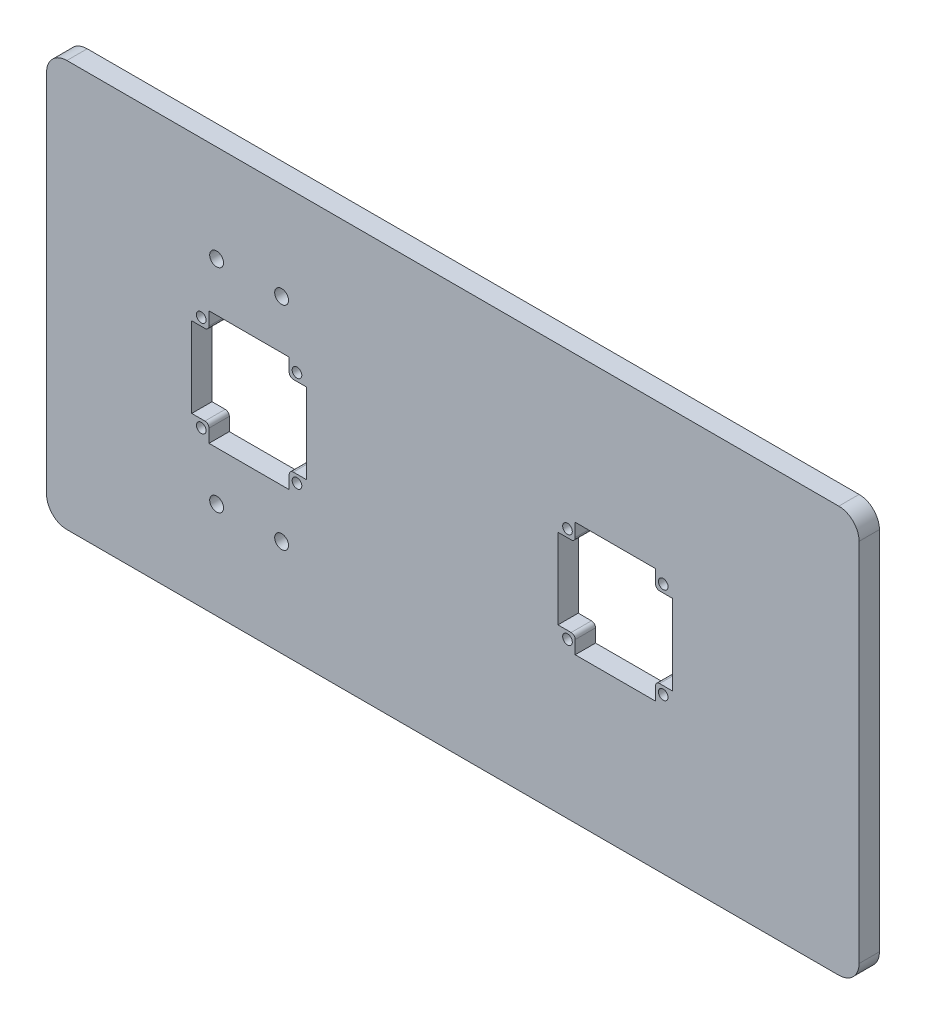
ISO-10303-21;
HEADER;
FILE_DESCRIPTION(('STEP AP214'),'2;1');
FILE_NAME('part.step','',(''),(''),'','','');
FILE_SCHEMA(('AUTOMOTIVE_DESIGN { 1 0 10303 214 1 1 1 1 }'));
ENDSEC;
DATA;
#1=APPLICATION_CONTEXT('core data for automotive mechanical design processes');
#2=APPLICATION_PROTOCOL_DEFINITION('international standard','automotive_design',2000,#1);
#3=PRODUCT_CONTEXT('',#1,'mechanical');
#4=PRODUCT('Part','Part','',(#3));
#5=PRODUCT_RELATED_PRODUCT_CATEGORY('part','',(#4));
#6=PRODUCT_DEFINITION_FORMATION('','',#4);
#7=PRODUCT_DEFINITION_CONTEXT('part definition',#1,'design');
#8=PRODUCT_DEFINITION('design','',#6,#7);
#9=PRODUCT_DEFINITION_SHAPE('','',#8);
#10=(LENGTH_UNIT() NAMED_UNIT(*) SI_UNIT(.MILLI.,.METRE.));
#11=(NAMED_UNIT(*) PLANE_ANGLE_UNIT() SI_UNIT($,.RADIAN.));
#12=(NAMED_UNIT(*) SI_UNIT($,.STERADIAN.) SOLID_ANGLE_UNIT());
#13=UNCERTAINTY_MEASURE_WITH_UNIT(LENGTH_MEASURE(1.E-05),#10,'distance_accuracy_value','');
#14=(GEOMETRIC_REPRESENTATION_CONTEXT(3) GLOBAL_UNCERTAINTY_ASSIGNED_CONTEXT((#13)) GLOBAL_UNIT_ASSIGNED_CONTEXT((#10,
#11,#12)) REPRESENTATION_CONTEXT('',''));
#15=CARTESIAN_POINT('',(0.,0.,0.));
#16=DIRECTION('',(0.,0.,1.));
#17=DIRECTION('',(1.,0.,0.));
#18=AXIS2_PLACEMENT_3D('',#15,#16,#17);
#19=CARTESIAN_POINT('',(0.,0.,10.));
#20=DIRECTION('',(0.,0.,1.));
#21=DIRECTION('',(1.,0.,0.));
#22=AXIS2_PLACEMENT_3D('',#19,#20,#21);
#23=PLANE('',#22);
#24=CARTESIAN_POINT('',(-116.3,52.25,10.));
#25=DIRECTION('',(0.,0.,1.));
#26=DIRECTION('',(1.,0.,0.));
#27=AXIS2_PLACEMENT_3D('',#24,#25,#26);
#28=CIRCLE('',#27,3.4);
#29=CARTESIAN_POINT('',(-112.9,52.25,10.));
#30=VERTEX_POINT('',#29);
#31=EDGE_CURVE('E964',#30,#30,#28,.T.);
#32=ORIENTED_EDGE('',*,*,#31,.F.);
#33=EDGE_LOOP('',(#32));
#34=FACE_BOUND('',#33,.T.);
#35=CARTESIAN_POINT('',(-84.3,52.25,10.));
#36=DIRECTION('',(0.,0.,1.));
#37=DIRECTION('',(1.,0.,0.));
#38=AXIS2_PLACEMENT_3D('',#35,#36,#37);
#39=CIRCLE('',#38,3.4);
#40=CARTESIAN_POINT('',(-80.9,52.25,10.));
#41=VERTEX_POINT('',#40);
#42=EDGE_CURVE('E966',#41,#41,#39,.T.);
#43=ORIENTED_EDGE('',*,*,#42,.F.);
#44=EDGE_LOOP('',(#43));
#45=FACE_BOUND('',#44,.T.);
#46=CARTESIAN_POINT('',(-84.3,-52.25,10.));
#47=DIRECTION('',(0.,0.,1.));
#48=DIRECTION('',(1.,0.,0.));
#49=AXIS2_PLACEMENT_3D('',#46,#47,#48);
#50=CIRCLE('',#49,3.4);
#51=CARTESIAN_POINT('',(-80.9,-52.25,10.));
#52=VERTEX_POINT('',#51);
#53=EDGE_CURVE('E971',#52,#52,#50,.T.);
#54=ORIENTED_EDGE('',*,*,#53,.F.);
#55=EDGE_LOOP('',(#54));
#56=FACE_BOUND('',#55,.T.);
#57=CARTESIAN_POINT('',(-116.3,-52.25,10.));
#58=DIRECTION('',(0.,0.,1.));
#59=DIRECTION('',(1.,0.,0.));
#60=AXIS2_PLACEMENT_3D('',#57,#58,#59);
#61=CIRCLE('',#60,3.4);
#62=CARTESIAN_POINT('',(-112.9,-52.25,10.));
#63=VERTEX_POINT('',#62);
#64=EDGE_CURVE('E974',#63,#63,#61,.T.);
#65=ORIENTED_EDGE('',*,*,#64,.F.);
#66=EDGE_LOOP('',(#65));
#67=FACE_BOUND('',#66,.T.);
#68=CARTESIAN_POINT('',(103.57,-23.57,10.));
#69=DIRECTION('',(0.,0.,1.));
#70=DIRECTION('',(1.,0.,0.));
#71=AXIS2_PLACEMENT_3D('',#68,#69,#70);
#72=CIRCLE('',#71,2.375);
#73=CARTESIAN_POINT('',(105.945,-23.57,10.));
#74=VERTEX_POINT('',#73);
#75=EDGE_CURVE('E847',#74,#74,#72,.F.);
#76=ORIENTED_EDGE('',*,*,#75,.T.);
#77=EDGE_LOOP('',(#76));
#78=FACE_BOUND('',#77,.T.);
#79=CARTESIAN_POINT('',(56.43,-23.57,10.));
#80=DIRECTION('',(0.,0.,1.));
#81=DIRECTION('',(1.,0.,0.));
#82=AXIS2_PLACEMENT_3D('',#79,#80,#81);
#83=CIRCLE('',#82,2.375);
#84=CARTESIAN_POINT('',(58.805,-23.57,10.));
#85=VERTEX_POINT('',#84);
#86=EDGE_CURVE('E855',#85,#85,#83,.F.);
#87=ORIENTED_EDGE('',*,*,#86,.T.);
#88=EDGE_LOOP('',(#87));
#89=FACE_BOUND('',#88,.T.);
#90=CARTESIAN_POINT('',(56.43,23.57,10.));
#91=DIRECTION('',(0.,0.,1.));
#92=DIRECTION('',(1.,0.,0.));
#93=AXIS2_PLACEMENT_3D('',#90,#91,#92);
#94=CIRCLE('',#93,2.375);
#95=CARTESIAN_POINT('',(58.805,23.57,10.));
#96=VERTEX_POINT('',#95);
#97=EDGE_CURVE('E839',#96,#96,#94,.F.);
#98=ORIENTED_EDGE('',*,*,#97,.T.);
#99=EDGE_LOOP('',(#98));
#100=FACE_BOUND('',#99,.T.);
#101=CARTESIAN_POINT('',(-123.87,-23.57,10.));
#102=DIRECTION('',(0.,0.,1.));
#103=DIRECTION('',(1.,0.,0.));
#104=AXIS2_PLACEMENT_3D('',#101,#102,#103);
#105=CIRCLE('',#104,2.37500000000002);
#106=CARTESIAN_POINT('',(-121.495,-23.57,10.));
#107=VERTEX_POINT('',#106);
#108=EDGE_CURVE('E945',#107,#107,#105,.T.);
#109=ORIENTED_EDGE('',*,*,#108,.F.);
#110=EDGE_LOOP('',(#109));
#111=FACE_BOUND('',#110,.T.);
#112=CARTESIAN_POINT('',(-123.87,23.57,10.));
#113=DIRECTION('',(0.,0.,1.));
#114=DIRECTION('',(1.,0.,0.));
#115=AXIS2_PLACEMENT_3D('',#112,#113,#114);
#116=CIRCLE('',#115,2.37500000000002);
#117=CARTESIAN_POINT('',(-121.495,23.57,10.));
#118=VERTEX_POINT('',#117);
#119=EDGE_CURVE('E948',#118,#118,#116,.T.);
#120=ORIENTED_EDGE('',*,*,#119,.F.);
#121=EDGE_LOOP('',(#120));
#122=FACE_BOUND('',#121,.T.);
#123=CARTESIAN_POINT('',(103.57,23.57,10.));
#124=DIRECTION('',(0.,0.,1.));
#125=DIRECTION('',(1.,0.,0.));
#126=AXIS2_PLACEMENT_3D('',#123,#124,#125);
#127=CIRCLE('',#126,2.375);
#128=CARTESIAN_POINT('',(105.945,23.57,10.));
#129=VERTEX_POINT('',#128);
#130=EDGE_CURVE('E330',#129,#129,#127,.F.);
#131=ORIENTED_EDGE('',*,*,#130,.T.);
#132=EDGE_LOOP('',(#131));
#133=FACE_BOUND('',#132,.T.);
#134=DIRECTION('',(0.,1.,0.));
#135=VECTOR('',#134,1.);
#136=CARTESIAN_POINT('',(-120.05,0.,10.));
#137=LINE('',#136,#135);
#138=CARTESIAN_POINT('',(-120.05,-28.25,10.));
#139=VERTEX_POINT('',#138);
#140=CARTESIAN_POINT('',(-120.05,-21.75,10.));
#141=VERTEX_POINT('',#140);
#142=EDGE_CURVE('E338',#139,#141,#137,.T.);
#143=ORIENTED_EDGE('',*,*,#142,.T.);
#144=CARTESIAN_POINT('',(-122.05,-21.75,10.));
#145=DIRECTION('',(0.,0.,1.));
#146=DIRECTION('',(1.,0.,0.));
#147=AXIS2_PLACEMENT_3D('',#144,#145,#146);
#148=CIRCLE('',#147,2.);
#149=CARTESIAN_POINT('',(-122.05,-19.75,10.));
#150=VERTEX_POINT('',#149);
#151=EDGE_CURVE('E545',#141,#150,#148,.T.);
#152=ORIENTED_EDGE('',*,*,#151,.T.);
#153=DIRECTION('',(1.,0.,0.));
#154=VECTOR('',#153,1.);
#155=CARTESIAN_POINT('',(0.,-19.75,10.));
#156=LINE('',#155,#154);
#157=CARTESIAN_POINT('',(-128.55,-19.75,10.));
#158=VERTEX_POINT('',#157);
#159=EDGE_CURVE('E340',#158,#150,#156,.T.);
#160=ORIENTED_EDGE('',*,*,#159,.F.);
#161=DIRECTION('',(0.,1.,0.));
#162=VECTOR('',#161,1.);
#163=CARTESIAN_POINT('',(-128.55,0.,10.));
#164=LINE('',#163,#162);
#165=CARTESIAN_POINT('',(-128.55,19.75,10.));
#166=VERTEX_POINT('',#165);
#167=EDGE_CURVE('E343',#158,#166,#164,.T.);
#168=ORIENTED_EDGE('',*,*,#167,.T.);
#169=DIRECTION('',(1.,0.,0.));
#170=VECTOR('',#169,1.);
#171=CARTESIAN_POINT('',(0.,19.75,10.));
#172=LINE('',#171,#170);
#173=CARTESIAN_POINT('',(-122.05,19.75,10.));
#174=VERTEX_POINT('',#173);
#175=EDGE_CURVE('E345',#166,#174,#172,.T.);
#176=ORIENTED_EDGE('',*,*,#175,.T.);
#177=CARTESIAN_POINT('',(-122.05,21.75,10.));
#178=DIRECTION('',(0.,0.,1.));
#179=DIRECTION('',(1.,0.,0.));
#180=AXIS2_PLACEMENT_3D('',#177,#178,#179);
#181=CIRCLE('',#180,2.);
#182=CARTESIAN_POINT('',(-120.05,21.75,10.));
#183=VERTEX_POINT('',#182);
#184=EDGE_CURVE('E539',#174,#183,#181,.T.);
#185=ORIENTED_EDGE('',*,*,#184,.T.);
#186=DIRECTION('',(0.,1.,0.));
#187=VECTOR('',#186,1.);
#188=CARTESIAN_POINT('',(-120.05,0.,10.));
#189=LINE('',#188,#187);
#190=CARTESIAN_POINT('',(-120.05,28.25,10.));
#191=VERTEX_POINT('',#190);
#192=EDGE_CURVE('E348',#183,#191,#189,.T.);
#193=ORIENTED_EDGE('',*,*,#192,.T.);
#194=DIRECTION('',(1.,0.,0.));
#195=VECTOR('',#194,1.);
#196=CARTESIAN_POINT('',(0.,28.25,10.));
#197=LINE('',#196,#195);
#198=CARTESIAN_POINT('',(-80.55,28.25,10.));
#199=VERTEX_POINT('',#198);
#200=EDGE_CURVE('E350',#191,#199,#197,.T.);
#201=ORIENTED_EDGE('',*,*,#200,.T.);
#202=DIRECTION('',(0.,-1.,0.));
#203=VECTOR('',#202,1.);
#204=CARTESIAN_POINT('',(-80.55,0.,10.));
#205=LINE('',#204,#203);
#206=CARTESIAN_POINT('',(-80.55,21.75,10.));
#207=VERTEX_POINT('',#206);
#208=EDGE_CURVE('E352',#199,#207,#205,.T.);
#209=ORIENTED_EDGE('',*,*,#208,.T.);
#210=CARTESIAN_POINT('',(-78.55,21.75,10.));
#211=DIRECTION('',(0.,0.,1.));
#212=DIRECTION('',(1.,0.,0.));
#213=AXIS2_PLACEMENT_3D('',#210,#211,#212);
#214=CIRCLE('',#213,2.);
#215=CARTESIAN_POINT('',(-78.55,19.75,10.));
#216=VERTEX_POINT('',#215);
#217=EDGE_CURVE('E541',#207,#216,#214,.T.);
#218=ORIENTED_EDGE('',*,*,#217,.T.);
#219=DIRECTION('',(-1.,0.,0.));
#220=VECTOR('',#219,1.);
#221=CARTESIAN_POINT('',(0.,19.75,10.));
#222=LINE('',#221,#220);
#223=CARTESIAN_POINT('',(-72.05,19.75,10.));
#224=VERTEX_POINT('',#223);
#225=EDGE_CURVE('E324',#224,#216,#222,.T.);
#226=ORIENTED_EDGE('',*,*,#225,.F.);
#227=DIRECTION('',(0.,1.,0.));
#228=VECTOR('',#227,1.);
#229=CARTESIAN_POINT('',(-72.05,0.,10.));
#230=LINE('',#229,#228);
#231=CARTESIAN_POINT('',(-72.05,-19.75,10.));
#232=VERTEX_POINT('',#231);
#233=EDGE_CURVE('E302',#232,#224,#230,.T.);
#234=ORIENTED_EDGE('',*,*,#233,.F.);
#235=DIRECTION('',(-1.,0.,0.));
#236=VECTOR('',#235,1.);
#237=CARTESIAN_POINT('',(0.,-19.75,10.));
#238=LINE('',#237,#236);
#239=CARTESIAN_POINT('',(-78.55,-19.75,10.));
#240=VERTEX_POINT('',#239);
#241=EDGE_CURVE('E313',#232,#240,#238,.T.);
#242=ORIENTED_EDGE('',*,*,#241,.T.);
#243=CARTESIAN_POINT('',(-78.55,-21.75,10.));
#244=DIRECTION('',(0.,0.,1.));
#245=DIRECTION('',(1.,0.,0.));
#246=AXIS2_PLACEMENT_3D('',#243,#244,#245);
#247=CIRCLE('',#246,2.);
#248=CARTESIAN_POINT('',(-80.55,-21.75,10.));
#249=VERTEX_POINT('',#248);
#250=EDGE_CURVE('E543',#240,#249,#247,.T.);
#251=ORIENTED_EDGE('',*,*,#250,.T.);
#252=DIRECTION('',(0.,1.,0.));
#253=VECTOR('',#252,1.);
#254=CARTESIAN_POINT('',(-80.55,0.,10.));
#255=LINE('',#254,#253);
#256=CARTESIAN_POINT('',(-80.55,-28.25,10.));
#257=VERTEX_POINT('',#256);
#258=EDGE_CURVE('E319',#257,#249,#255,.T.);
#259=ORIENTED_EDGE('',*,*,#258,.F.);
#260=DIRECTION('',(1.,0.,0.));
#261=VECTOR('',#260,1.);
#262=CARTESIAN_POINT('',(0.,-28.25,10.));
#263=LINE('',#262,#261);
#264=EDGE_CURVE('E335',#139,#257,#263,.T.);
#265=ORIENTED_EDGE('',*,*,#264,.F.);
#266=EDGE_LOOP('',(#143,#152,#160,#168,#176,#185,#193,#201,#209,#218,#226,#234,#242,#251,#259,#265));
#267=FACE_BOUND('',#266,.T.);
#268=DIRECTION('',(0.,1.,0.));
#269=VECTOR('',#268,1.);
#270=CARTESIAN_POINT('',(60.25,0.,10.));
#271=LINE('',#270,#269);
#272=CARTESIAN_POINT('',(60.25,-28.25,10.));
#273=VERTEX_POINT('',#272);
#274=CARTESIAN_POINT('',(60.25,-21.75,10.));
#275=VERTEX_POINT('',#274);
#276=EDGE_CURVE('E380',#273,#275,#271,.T.);
#277=ORIENTED_EDGE('',*,*,#276,.T.);
#278=CARTESIAN_POINT('',(58.25,-21.75,10.));
#279=DIRECTION('',(0.,0.,1.));
#280=DIRECTION('',(1.,0.,0.));
#281=AXIS2_PLACEMENT_3D('',#278,#279,#280);
#282=CIRCLE('',#281,2.);
#283=CARTESIAN_POINT('',(58.25,-19.75,10.));
#284=VERTEX_POINT('',#283);
#285=EDGE_CURVE('E537',#275,#284,#282,.T.);
#286=ORIENTED_EDGE('',*,*,#285,.T.);
#287=DIRECTION('',(1.,0.,0.));
#288=VECTOR('',#287,1.);
#289=CARTESIAN_POINT('',(0.,-19.75,10.));
#290=LINE('',#289,#288);
#291=CARTESIAN_POINT('',(51.75,-19.75,10.));
#292=VERTEX_POINT('',#291);
#293=EDGE_CURVE('E383',#292,#284,#290,.T.);
#294=ORIENTED_EDGE('',*,*,#293,.F.);
#295=DIRECTION('',(0.,-1.,0.));
#296=VECTOR('',#295,1.);
#297=CARTESIAN_POINT('',(51.75,0.,10.));
#298=LINE('',#297,#296);
#299=CARTESIAN_POINT('',(51.75,19.75,10.));
#300=VERTEX_POINT('',#299);
#301=EDGE_CURVE('E386',#300,#292,#298,.T.);
#302=ORIENTED_EDGE('',*,*,#301,.F.);
#303=DIRECTION('',(1.,0.,0.));
#304=VECTOR('',#303,1.);
#305=CARTESIAN_POINT('',(0.,19.75,10.));
#306=LINE('',#305,#304);
#307=CARTESIAN_POINT('',(58.25,19.75,10.));
#308=VERTEX_POINT('',#307);
#309=EDGE_CURVE('E389',#300,#308,#306,.T.);
#310=ORIENTED_EDGE('',*,*,#309,.T.);
#311=CARTESIAN_POINT('',(58.25,21.75,10.));
#312=DIRECTION('',(0.,0.,1.));
#313=DIRECTION('',(1.,0.,0.));
#314=AXIS2_PLACEMENT_3D('',#311,#312,#313);
#315=CIRCLE('',#314,2.);
#316=CARTESIAN_POINT('',(60.25,21.75,10.));
#317=VERTEX_POINT('',#316);
#318=EDGE_CURVE('E533',#308,#317,#315,.T.);
#319=ORIENTED_EDGE('',*,*,#318,.T.);
#320=DIRECTION('',(0.,-1.,0.));
#321=VECTOR('',#320,1.);
#322=CARTESIAN_POINT('',(60.25,0.,10.));
#323=LINE('',#322,#321);
#324=CARTESIAN_POINT('',(60.25,28.25,10.));
#325=VERTEX_POINT('',#324);
#326=EDGE_CURVE('E356',#325,#317,#323,.T.);
#327=ORIENTED_EDGE('',*,*,#326,.F.);
#328=DIRECTION('',(1.,0.,0.));
#329=VECTOR('',#328,1.);
#330=CARTESIAN_POINT('',(0.,28.25,10.));
#331=LINE('',#330,#329);
#332=CARTESIAN_POINT('',(99.75,28.25,10.));
#333=VERTEX_POINT('',#332);
#334=EDGE_CURVE('E359',#325,#333,#331,.T.);
#335=ORIENTED_EDGE('',*,*,#334,.T.);
#336=DIRECTION('',(0.,-1.,0.));
#337=VECTOR('',#336,1.);
#338=CARTESIAN_POINT('',(99.75,0.,10.));
#339=LINE('',#338,#337);
#340=CARTESIAN_POINT('',(99.75,21.75,10.));
#341=VERTEX_POINT('',#340);
#342=EDGE_CURVE('E362',#333,#341,#339,.T.);
#343=ORIENTED_EDGE('',*,*,#342,.T.);
#344=CARTESIAN_POINT('',(101.75,21.75,10.));
#345=DIRECTION('',(0.,0.,1.));
#346=DIRECTION('',(1.,0.,0.));
#347=AXIS2_PLACEMENT_3D('',#344,#345,#346);
#348=CIRCLE('',#347,2.);
#349=CARTESIAN_POINT('',(101.75,19.75,10.));
#350=VERTEX_POINT('',#349);
#351=EDGE_CURVE('E531',#341,#350,#348,.T.);
#352=ORIENTED_EDGE('',*,*,#351,.T.);
#353=DIRECTION('',(-1.,0.,0.));
#354=VECTOR('',#353,1.);
#355=CARTESIAN_POINT('',(0.,19.75,10.));
#356=LINE('',#355,#354);
#357=CARTESIAN_POINT('',(108.25,19.75,10.));
#358=VERTEX_POINT('',#357);
#359=EDGE_CURVE('E365',#358,#350,#356,.T.);
#360=ORIENTED_EDGE('',*,*,#359,.F.);
#361=DIRECTION('',(0.,-1.,0.));
#362=VECTOR('',#361,1.);
#363=CARTESIAN_POINT('',(108.25,0.,10.));
#364=LINE('',#363,#362);
#365=CARTESIAN_POINT('',(108.25,-19.75,10.));
#366=VERTEX_POINT('',#365);
#367=EDGE_CURVE('E368',#358,#366,#364,.T.);
#368=ORIENTED_EDGE('',*,*,#367,.T.);
#369=DIRECTION('',(-1.,0.,0.));
#370=VECTOR('',#369,1.);
#371=CARTESIAN_POINT('',(0.,-19.75,10.));
#372=LINE('',#371,#370);
#373=CARTESIAN_POINT('',(101.75,-19.75,10.));
#374=VERTEX_POINT('',#373);
#375=EDGE_CURVE('E371',#366,#374,#372,.T.);
#376=ORIENTED_EDGE('',*,*,#375,.T.);
#377=CARTESIAN_POINT('',(101.75,-21.75,10.));
#378=DIRECTION('',(0.,0.,1.));
#379=DIRECTION('',(1.,0.,0.));
#380=AXIS2_PLACEMENT_3D('',#377,#378,#379);
#381=CIRCLE('',#380,2.);
#382=CARTESIAN_POINT('',(99.75,-21.75,10.));
#383=VERTEX_POINT('',#382);
#384=EDGE_CURVE('E535',#374,#383,#381,.T.);
#385=ORIENTED_EDGE('',*,*,#384,.T.);
#386=DIRECTION('',(0.,1.,0.));
#387=VECTOR('',#386,1.);
#388=CARTESIAN_POINT('',(99.75,0.,10.));
#389=LINE('',#388,#387);
#390=CARTESIAN_POINT('',(99.75,-28.25,10.));
#391=VERTEX_POINT('',#390);
#392=EDGE_CURVE('E374',#391,#383,#389,.T.);
#393=ORIENTED_EDGE('',*,*,#392,.F.);
#394=DIRECTION('',(1.,0.,0.));
#395=VECTOR('',#394,1.);
#396=CARTESIAN_POINT('',(0.,-28.25,10.));
#397=LINE('',#396,#395);
#398=EDGE_CURVE('E377',#273,#391,#397,.T.);
#399=ORIENTED_EDGE('',*,*,#398,.F.);
#400=EDGE_LOOP('',(#277,#286,#294,#302,#310,#319,#327,#335,#343,#352,#360,#368,#376,#385,#393,#399));
#401=FACE_BOUND('',#400,.T.);
#402=DIRECTION('',(0.,1.,0.));
#403=VECTOR('',#402,1.);
#404=CARTESIAN_POINT('',(-200.,0.,10.));
#405=LINE('',#404,#403);
#406=CARTESIAN_POINT('',(-200.,-90.,10.));
#407=VERTEX_POINT('',#406);
#408=CARTESIAN_POINT('',(-200.,90.,10.));
#409=VERTEX_POINT('',#408);
#410=EDGE_CURVE('E392',#407,#409,#405,.T.);
#411=ORIENTED_EDGE('',*,*,#410,.F.);
#412=CARTESIAN_POINT('',(-190.,-90.,10.));
#413=DIRECTION('',(0.,0.,1.));
#414=DIRECTION('',(1.,0.,0.));
#415=AXIS2_PLACEMENT_3D('',#412,#413,#414);
#416=CIRCLE('',#415,10.);
#417=CARTESIAN_POINT('',(-190.,-100.,10.));
#418=VERTEX_POINT('',#417);
#419=EDGE_CURVE('E604',#407,#418,#416,.T.);
#420=ORIENTED_EDGE('',*,*,#419,.T.);
#421=DIRECTION('',(-1.,0.,0.));
#422=VECTOR('',#421,1.);
#423=CARTESIAN_POINT('',(0.,-100.,10.));
#424=LINE('',#423,#422);
#425=CARTESIAN_POINT('',(190.,-99.9999999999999,10.));
#426=VERTEX_POINT('',#425);
#427=EDGE_CURVE('E395',#426,#418,#424,.T.);
#428=ORIENTED_EDGE('',*,*,#427,.F.);
#429=CARTESIAN_POINT('',(190.,-90.,10.));
#430=DIRECTION('',(0.,0.,1.));
#431=DIRECTION('',(1.,0.,0.));
#432=AXIS2_PLACEMENT_3D('',#429,#430,#431);
#433=CIRCLE('',#432,10.);
#434=CARTESIAN_POINT('',(200.,-90.,10.));
#435=VERTEX_POINT('',#434);
#436=EDGE_CURVE('E600',#426,#435,#433,.T.);
#437=ORIENTED_EDGE('',*,*,#436,.T.);
#438=DIRECTION('',(0.,1.,0.));
#439=VECTOR('',#438,1.);
#440=CARTESIAN_POINT('',(200.,0.,10.));
#441=LINE('',#440,#439);
#442=CARTESIAN_POINT('',(200.,90.0000000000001,10.));
#443=VERTEX_POINT('',#442);
#444=EDGE_CURVE('E398',#435,#443,#441,.T.);
#445=ORIENTED_EDGE('',*,*,#444,.T.);
#446=CARTESIAN_POINT('',(190.,90.0000000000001,10.));
#447=DIRECTION('',(0.,0.,1.));
#448=DIRECTION('',(1.,0.,0.));
#449=AXIS2_PLACEMENT_3D('',#446,#447,#448);
#450=CIRCLE('',#449,10.);
#451=CARTESIAN_POINT('',(190.,100.,10.));
#452=VERTEX_POINT('',#451);
#453=EDGE_CURVE('E61',#443,#452,#450,.T.);
#454=ORIENTED_EDGE('',*,*,#453,.T.);
#455=DIRECTION('',(-1.,0.,0.));
#456=VECTOR('',#455,1.);
#457=CARTESIAN_POINT('',(0.,100.,10.));
#458=LINE('',#457,#456);
#459=CARTESIAN_POINT('',(-190.,100.,10.));
#460=VERTEX_POINT('',#459);
#461=EDGE_CURVE('E400',#452,#460,#458,.T.);
#462=ORIENTED_EDGE('',*,*,#461,.T.);
#463=CARTESIAN_POINT('',(-190.,90.,10.));
#464=DIRECTION('',(0.,0.,1.));
#465=DIRECTION('',(1.,0.,0.));
#466=AXIS2_PLACEMENT_3D('',#463,#464,#465);
#467=CIRCLE('',#466,10.);
#468=EDGE_CURVE('E602',#460,#409,#467,.T.);
#469=ORIENTED_EDGE('',*,*,#468,.T.);
#470=EDGE_LOOP('',(#411,#420,#428,#437,#445,#454,#462,#469));
#471=FACE_BOUND('',#470,.T.);
#472=CARTESIAN_POINT('',(-76.73,-23.57,10.));
#473=DIRECTION('',(0.,0.,1.));
#474=DIRECTION('',(1.,0.,0.));
#475=AXIS2_PLACEMENT_3D('',#472,#473,#474);
#476=CIRCLE('',#475,2.37499999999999);
#477=CARTESIAN_POINT('',(-74.355,-23.57,10.));
#478=VERTEX_POINT('',#477);
#479=EDGE_CURVE('E954',#478,#478,#476,.T.);
#480=ORIENTED_EDGE('',*,*,#479,.F.);
#481=EDGE_LOOP('',(#480));
#482=FACE_BOUND('',#481,.T.);
#483=CARTESIAN_POINT('',(-76.73,23.57,10.));
#484=DIRECTION('',(0.,0.,1.));
#485=DIRECTION('',(1.,0.,0.));
#486=AXIS2_PLACEMENT_3D('',#483,#484,#485);
#487=CIRCLE('',#486,2.37499999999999);
#488=CARTESIAN_POINT('',(-74.355,23.57,10.));
#489=VERTEX_POINT('',#488);
#490=EDGE_CURVE('E831',#489,#489,#487,.T.);
#491=ORIENTED_EDGE('',*,*,#490,.F.);
#492=EDGE_LOOP('',(#491));
#493=FACE_BOUND('',#492,.T.);
#494=ADVANCED_FACE('F39',(#34,#45,#56,#67,#78,#89,#100,#111,#122,#133,#267,#401,#471,#482,#493),
#23,.T.);
#495=CARTESIAN_POINT('',(0.,0.,0.));
#496=DIRECTION('',(0.,0.,1.));
#497=DIRECTION('',(1.,0.,0.));
#498=AXIS2_PLACEMENT_3D('',#495,#496,#497);
#499=PLANE('',#498);
#500=CARTESIAN_POINT('',(-116.3,52.25,0.));
#501=DIRECTION('',(0.,0.,-1.));
#502=DIRECTION('',(-1.,0.,0.));
#503=AXIS2_PLACEMENT_3D('',#500,#501,#502);
#504=CIRCLE('',#503,3.4);
#505=CARTESIAN_POINT('',(-119.7,52.25,0.));
#506=VERTEX_POINT('',#505);
#507=EDGE_CURVE('E981',#506,#506,#504,.T.);
#508=ORIENTED_EDGE('',*,*,#507,.F.);
#509=EDGE_LOOP('',(#508));
#510=FACE_BOUND('',#509,.T.);
#511=CARTESIAN_POINT('',(-84.3,52.25,0.));
#512=DIRECTION('',(0.,0.,-1.));
#513=DIRECTION('',(-1.,0.,0.));
#514=AXIS2_PLACEMENT_3D('',#511,#512,#513);
#515=CIRCLE('',#514,3.4);
#516=CARTESIAN_POINT('',(-87.7,52.25,0.));
#517=VERTEX_POINT('',#516);
#518=EDGE_CURVE('E984',#517,#517,#515,.T.);
#519=ORIENTED_EDGE('',*,*,#518,.F.);
#520=EDGE_LOOP('',(#519));
#521=FACE_BOUND('',#520,.T.);
#522=CARTESIAN_POINT('',(-84.3,-52.25,0.));
#523=DIRECTION('',(0.,0.,-1.));
#524=DIRECTION('',(-1.,0.,0.));
#525=AXIS2_PLACEMENT_3D('',#522,#523,#524);
#526=CIRCLE('',#525,3.4);
#527=CARTESIAN_POINT('',(-87.7,-52.25,0.));
#528=VERTEX_POINT('',#527);
#529=EDGE_CURVE('E980',#528,#528,#526,.T.);
#530=ORIENTED_EDGE('',*,*,#529,.F.);
#531=EDGE_LOOP('',(#530));
#532=FACE_BOUND('',#531,.T.);
#533=CARTESIAN_POINT('',(-116.3,-52.25,0.));
#534=DIRECTION('',(0.,0.,-1.));
#535=DIRECTION('',(-1.,0.,0.));
#536=AXIS2_PLACEMENT_3D('',#533,#534,#535);
#537=CIRCLE('',#536,3.4);
#538=CARTESIAN_POINT('',(-119.7,-52.25,0.));
#539=VERTEX_POINT('',#538);
#540=EDGE_CURVE('E977',#539,#539,#537,.T.);
#541=ORIENTED_EDGE('',*,*,#540,.F.);
#542=EDGE_LOOP('',(#541));
#543=FACE_BOUND('',#542,.T.);
#544=CARTESIAN_POINT('',(103.57,-23.57,0.));
#545=DIRECTION('',(0.,0.,-1.));
#546=DIRECTION('',(-1.,0.,0.));
#547=AXIS2_PLACEMENT_3D('',#544,#545,#546);
#548=CIRCLE('',#547,2.375);
#549=CARTESIAN_POINT('',(101.195,-23.57,0.));
#550=VERTEX_POINT('',#549);
#551=EDGE_CURVE('E851',#550,#550,#548,.T.);
#552=ORIENTED_EDGE('',*,*,#551,.F.);
#553=EDGE_LOOP('',(#552));
#554=FACE_BOUND('',#553,.T.);
#555=CARTESIAN_POINT('',(56.43,-23.57,0.));
#556=DIRECTION('',(0.,0.,-1.));
#557=DIRECTION('',(-1.,0.,0.));
#558=AXIS2_PLACEMENT_3D('',#555,#556,#557);
#559=CIRCLE('',#558,2.375);
#560=CARTESIAN_POINT('',(54.055,-23.57,0.));
#561=VERTEX_POINT('',#560);
#562=EDGE_CURVE('E863',#561,#561,#559,.T.);
#563=ORIENTED_EDGE('',*,*,#562,.F.);
#564=EDGE_LOOP('',(#563));
#565=FACE_BOUND('',#564,.T.);
#566=CARTESIAN_POINT('',(56.43,23.57,0.));
#567=DIRECTION('',(0.,0.,-1.));
#568=DIRECTION('',(-1.,0.,0.));
#569=AXIS2_PLACEMENT_3D('',#566,#567,#568);
#570=CIRCLE('',#569,2.375);
#571=CARTESIAN_POINT('',(54.055,23.57,0.));
#572=VERTEX_POINT('',#571);
#573=EDGE_CURVE('E836',#572,#572,#570,.T.);
#574=ORIENTED_EDGE('',*,*,#573,.F.);
#575=EDGE_LOOP('',(#574));
#576=FACE_BOUND('',#575,.T.);
#577=CARTESIAN_POINT('',(103.57,23.57,0.));
#578=DIRECTION('',(0.,0.,-1.));
#579=DIRECTION('',(-1.,0.,0.));
#580=AXIS2_PLACEMENT_3D('',#577,#578,#579);
#581=CIRCLE('',#580,2.375);
#582=CARTESIAN_POINT('',(101.195,23.57,0.));
#583=VERTEX_POINT('',#582);
#584=EDGE_CURVE('E405',#583,#583,#581,.T.);
#585=ORIENTED_EDGE('',*,*,#584,.F.);
#586=EDGE_LOOP('',(#585));
#587=FACE_BOUND('',#586,.T.);
#588=DIRECTION('',(1.,0.,0.));
#589=VECTOR('',#588,1.);
#590=CARTESIAN_POINT('',(0.,-19.75,0.));
#591=LINE('',#590,#589);
#592=CARTESIAN_POINT('',(-128.55,-19.75,0.));
#593=VERTEX_POINT('',#592);
#594=CARTESIAN_POINT('',(-122.05,-19.75,0.));
#595=VERTEX_POINT('',#594);
#596=EDGE_CURVE('E416',#593,#595,#591,.T.);
#597=ORIENTED_EDGE('',*,*,#596,.T.);
#598=CARTESIAN_POINT('',(-122.05,-21.75,0.));
#599=DIRECTION('',(0.,0.,1.));
#600=DIRECTION('',(1.,0.,0.));
#601=AXIS2_PLACEMENT_3D('',#598,#599,#600);
#602=CIRCLE('',#601,2.);
#603=CARTESIAN_POINT('',(-120.05,-21.75,0.));
#604=VERTEX_POINT('',#603);
#605=EDGE_CURVE('E527',#595,#604,#602,.F.);
#606=ORIENTED_EDGE('',*,*,#605,.T.);
#607=DIRECTION('',(0.,1.,0.));
#608=VECTOR('',#607,1.);
#609=CARTESIAN_POINT('',(-120.05,0.,0.));
#610=LINE('',#609,#608);
#611=CARTESIAN_POINT('',(-120.05,-28.25,0.));
#612=VERTEX_POINT('',#611);
#613=EDGE_CURVE('E413',#612,#604,#610,.T.);
#614=ORIENTED_EDGE('',*,*,#613,.F.);
#615=DIRECTION('',(1.,0.,0.));
#616=VECTOR('',#615,1.);
#617=CARTESIAN_POINT('',(0.,-28.25,0.));
#618=LINE('',#617,#616);
#619=CARTESIAN_POINT('',(-80.55,-28.25,0.));
#620=VERTEX_POINT('',#619);
#621=EDGE_CURVE('E410',#612,#620,#618,.T.);
#622=ORIENTED_EDGE('',*,*,#621,.T.);
#623=DIRECTION('',(0.,1.,0.));
#624=VECTOR('',#623,1.);
#625=CARTESIAN_POINT('',(-80.55,0.,0.));
#626=LINE('',#625,#624);
#627=CARTESIAN_POINT('',(-80.55,-21.75,0.));
#628=VERTEX_POINT('',#627);
#629=EDGE_CURVE('E407',#620,#628,#626,.T.);
#630=ORIENTED_EDGE('',*,*,#629,.T.);
#631=CARTESIAN_POINT('',(-78.55,-21.75,0.));
#632=DIRECTION('',(0.,0.,1.));
#633=DIRECTION('',(1.,0.,0.));
#634=AXIS2_PLACEMENT_3D('',#631,#632,#633);
#635=CIRCLE('',#634,2.);
#636=CARTESIAN_POINT('',(-78.55,-19.75,0.));
#637=VERTEX_POINT('',#636);
#638=EDGE_CURVE('E525',#628,#637,#635,.F.);
#639=ORIENTED_EDGE('',*,*,#638,.T.);
#640=DIRECTION('',(-1.,0.,0.));
#641=VECTOR('',#640,1.);
#642=CARTESIAN_POINT('',(0.,-19.75,0.));
#643=LINE('',#642,#641);
#644=CARTESIAN_POINT('',(-72.05,-19.75,0.));
#645=VERTEX_POINT('',#644);
#646=EDGE_CURVE('E404',#645,#637,#643,.T.);
#647=ORIENTED_EDGE('',*,*,#646,.F.);
#648=DIRECTION('',(0.,1.,0.));
#649=VECTOR('',#648,1.);
#650=CARTESIAN_POINT('',(-72.05,0.,0.));
#651=LINE('',#650,#649);
#652=CARTESIAN_POINT('',(-72.05,19.75,0.));
#653=VERTEX_POINT('',#652);
#654=EDGE_CURVE('E305',#645,#653,#651,.T.);
#655=ORIENTED_EDGE('',*,*,#654,.T.);
#656=DIRECTION('',(-1.,0.,0.));
#657=VECTOR('',#656,1.);
#658=CARTESIAN_POINT('',(0.,19.75,0.));
#659=LINE('',#658,#657);
#660=CARTESIAN_POINT('',(-78.55,19.75,0.));
#661=VERTEX_POINT('',#660);
#662=EDGE_CURVE('E431',#653,#661,#659,.T.);
#663=ORIENTED_EDGE('',*,*,#662,.T.);
#664=CARTESIAN_POINT('',(-78.55,21.75,0.));
#665=DIRECTION('',(0.,0.,1.));
#666=DIRECTION('',(1.,0.,0.));
#667=AXIS2_PLACEMENT_3D('',#664,#665,#666);
#668=CIRCLE('',#667,2.);
#669=CARTESIAN_POINT('',(-80.55,21.75,0.));
#670=VERTEX_POINT('',#669);
#671=EDGE_CURVE('E523',#661,#670,#668,.F.);
#672=ORIENTED_EDGE('',*,*,#671,.T.);
#673=DIRECTION('',(0.,-1.,0.));
#674=VECTOR('',#673,1.);
#675=CARTESIAN_POINT('',(-80.55,0.,0.));
#676=LINE('',#675,#674);
#677=CARTESIAN_POINT('',(-80.55,28.25,0.));
#678=VERTEX_POINT('',#677);
#679=EDGE_CURVE('E428',#678,#670,#676,.T.);
#680=ORIENTED_EDGE('',*,*,#679,.F.);
#681=DIRECTION('',(1.,0.,0.));
#682=VECTOR('',#681,1.);
#683=CARTESIAN_POINT('',(0.,28.25,0.));
#684=LINE('',#683,#682);
#685=CARTESIAN_POINT('',(-120.05,28.25,0.));
#686=VERTEX_POINT('',#685);
#687=EDGE_CURVE('E426',#686,#678,#684,.T.);
#688=ORIENTED_EDGE('',*,*,#687,.F.);
#689=DIRECTION('',(0.,1.,0.));
#690=VECTOR('',#689,1.);
#691=CARTESIAN_POINT('',(-120.05,0.,0.));
#692=LINE('',#691,#690);
#693=CARTESIAN_POINT('',(-120.05,21.75,0.));
#694=VERTEX_POINT('',#693);
#695=EDGE_CURVE('E424',#694,#686,#692,.T.);
#696=ORIENTED_EDGE('',*,*,#695,.F.);
#697=CARTESIAN_POINT('',(-122.05,21.75,0.));
#698=DIRECTION('',(0.,0.,1.));
#699=DIRECTION('',(1.,0.,0.));
#700=AXIS2_PLACEMENT_3D('',#697,#698,#699);
#701=CIRCLE('',#700,2.);
#702=CARTESIAN_POINT('',(-122.05,19.75,0.));
#703=VERTEX_POINT('',#702);
#704=EDGE_CURVE('E521',#694,#703,#701,.F.);
#705=ORIENTED_EDGE('',*,*,#704,.T.);
#706=DIRECTION('',(1.,0.,0.));
#707=VECTOR('',#706,1.);
#708=CARTESIAN_POINT('',(0.,19.75,0.));
#709=LINE('',#708,#707);
#710=CARTESIAN_POINT('',(-128.55,19.75,0.));
#711=VERTEX_POINT('',#710);
#712=EDGE_CURVE('E421',#711,#703,#709,.T.);
#713=ORIENTED_EDGE('',*,*,#712,.F.);
#714=DIRECTION('',(0.,1.,0.));
#715=VECTOR('',#714,1.);
#716=CARTESIAN_POINT('',(-128.55,0.,0.));
#717=LINE('',#716,#715);
#718=EDGE_CURVE('E419',#593,#711,#717,.T.);
#719=ORIENTED_EDGE('',*,*,#718,.F.);
#720=EDGE_LOOP('',(#597,#606,#614,#622,#630,#639,#647,#655,#663,#672,#680,#688,#696,#705,#713,#719));
#721=FACE_BOUND('',#720,.T.);
#722=DIRECTION('',(1.,0.,0.));
#723=VECTOR('',#722,1.);
#724=CARTESIAN_POINT('',(0.,-19.75,0.));
#725=LINE('',#724,#723);
#726=CARTESIAN_POINT('',(51.75,-19.75,0.));
#727=VERTEX_POINT('',#726);
#728=CARTESIAN_POINT('',(58.25,-19.75,0.));
#729=VERTEX_POINT('',#728);
#730=EDGE_CURVE('E461',#727,#729,#725,.T.);
#731=ORIENTED_EDGE('',*,*,#730,.T.);
#732=CARTESIAN_POINT('',(58.25,-21.75,0.));
#733=DIRECTION('',(0.,0.,1.));
#734=DIRECTION('',(1.,0.,0.));
#735=AXIS2_PLACEMENT_3D('',#732,#733,#734);
#736=CIRCLE('',#735,2.);
#737=CARTESIAN_POINT('',(60.25,-21.75,0.));
#738=VERTEX_POINT('',#737);
#739=EDGE_CURVE('E519',#729,#738,#736,.F.);
#740=ORIENTED_EDGE('',*,*,#739,.T.);
#741=DIRECTION('',(0.,1.,0.));
#742=VECTOR('',#741,1.);
#743=CARTESIAN_POINT('',(60.25,0.,0.));
#744=LINE('',#743,#742);
#745=CARTESIAN_POINT('',(60.25,-28.25,0.));
#746=VERTEX_POINT('',#745);
#747=EDGE_CURVE('E458',#746,#738,#744,.T.);
#748=ORIENTED_EDGE('',*,*,#747,.F.);
#749=DIRECTION('',(1.,0.,0.));
#750=VECTOR('',#749,1.);
#751=CARTESIAN_POINT('',(0.,-28.25,0.));
#752=LINE('',#751,#750);
#753=CARTESIAN_POINT('',(99.75,-28.25,0.));
#754=VERTEX_POINT('',#753);
#755=EDGE_CURVE('E455',#746,#754,#752,.T.);
#756=ORIENTED_EDGE('',*,*,#755,.T.);
#757=DIRECTION('',(0.,1.,0.));
#758=VECTOR('',#757,1.);
#759=CARTESIAN_POINT('',(99.75,0.,0.));
#760=LINE('',#759,#758);
#761=CARTESIAN_POINT('',(99.75,-21.75,0.));
#762=VERTEX_POINT('',#761);
#763=EDGE_CURVE('E452',#754,#762,#760,.T.);
#764=ORIENTED_EDGE('',*,*,#763,.T.);
#765=CARTESIAN_POINT('',(101.75,-21.75,0.));
#766=DIRECTION('',(0.,0.,1.));
#767=DIRECTION('',(1.,0.,0.));
#768=AXIS2_PLACEMENT_3D('',#765,#766,#767);
#769=CIRCLE('',#768,2.);
#770=CARTESIAN_POINT('',(101.75,-19.75,0.));
#771=VERTEX_POINT('',#770);
#772=EDGE_CURVE('E517',#762,#771,#769,.F.);
#773=ORIENTED_EDGE('',*,*,#772,.T.);
#774=DIRECTION('',(-1.,0.,0.));
#775=VECTOR('',#774,1.);
#776=CARTESIAN_POINT('',(0.,-19.75,0.));
#777=LINE('',#776,#775);
#778=CARTESIAN_POINT('',(108.25,-19.75,0.));
#779=VERTEX_POINT('',#778);
#780=EDGE_CURVE('E449',#779,#771,#777,.T.);
#781=ORIENTED_EDGE('',*,*,#780,.F.);
#782=DIRECTION('',(0.,-1.,0.));
#783=VECTOR('',#782,1.);
#784=CARTESIAN_POINT('',(108.25,0.,0.));
#785=LINE('',#784,#783);
#786=CARTESIAN_POINT('',(108.25,19.75,0.));
#787=VERTEX_POINT('',#786);
#788=EDGE_CURVE('E446',#787,#779,#785,.T.);
#789=ORIENTED_EDGE('',*,*,#788,.F.);
#790=DIRECTION('',(-1.,0.,0.));
#791=VECTOR('',#790,1.);
#792=CARTESIAN_POINT('',(0.,19.75,0.));
#793=LINE('',#792,#791);
#794=CARTESIAN_POINT('',(101.75,19.75,0.));
#795=VERTEX_POINT('',#794);
#796=EDGE_CURVE('E443',#787,#795,#793,.T.);
#797=ORIENTED_EDGE('',*,*,#796,.T.);
#798=CARTESIAN_POINT('',(101.75,21.75,0.));
#799=DIRECTION('',(0.,0.,1.));
#800=DIRECTION('',(1.,0.,0.));
#801=AXIS2_PLACEMENT_3D('',#798,#799,#800);
#802=CIRCLE('',#801,2.);
#803=CARTESIAN_POINT('',(99.75,21.75,0.));
#804=VERTEX_POINT('',#803);
#805=EDGE_CURVE('E513',#795,#804,#802,.F.);
#806=ORIENTED_EDGE('',*,*,#805,.T.);
#807=DIRECTION('',(0.,-1.,0.));
#808=VECTOR('',#807,1.);
#809=CARTESIAN_POINT('',(99.75,0.,0.));
#810=LINE('',#809,#808);
#811=CARTESIAN_POINT('',(99.75,28.25,0.));
#812=VERTEX_POINT('',#811);
#813=EDGE_CURVE('E440',#812,#804,#810,.T.);
#814=ORIENTED_EDGE('',*,*,#813,.F.);
#815=DIRECTION('',(1.,0.,0.));
#816=VECTOR('',#815,1.);
#817=CARTESIAN_POINT('',(0.,28.25,0.));
#818=LINE('',#817,#816);
#819=CARTESIAN_POINT('',(60.25,28.25,0.));
#820=VERTEX_POINT('',#819);
#821=EDGE_CURVE('E437',#820,#812,#818,.T.);
#822=ORIENTED_EDGE('',*,*,#821,.F.);
#823=DIRECTION('',(0.,-1.,0.));
#824=VECTOR('',#823,1.);
#825=CARTESIAN_POINT('',(60.25,0.,0.));
#826=LINE('',#825,#824);
#827=CARTESIAN_POINT('',(60.25,21.75,0.));
#828=VERTEX_POINT('',#827);
#829=EDGE_CURVE('E434',#820,#828,#826,.T.);
#830=ORIENTED_EDGE('',*,*,#829,.T.);
#831=CARTESIAN_POINT('',(58.25,21.75,0.));
#832=DIRECTION('',(0.,0.,1.));
#833=DIRECTION('',(1.,0.,0.));
#834=AXIS2_PLACEMENT_3D('',#831,#832,#833);
#835=CIRCLE('',#834,2.);
#836=CARTESIAN_POINT('',(58.25,19.75,0.));
#837=VERTEX_POINT('',#836);
#838=EDGE_CURVE('E515',#828,#837,#835,.F.);
#839=ORIENTED_EDGE('',*,*,#838,.T.);
#840=DIRECTION('',(1.,0.,0.));
#841=VECTOR('',#840,1.);
#842=CARTESIAN_POINT('',(0.,19.75,0.));
#843=LINE('',#842,#841);
#844=CARTESIAN_POINT('',(51.75,19.75,0.));
#845=VERTEX_POINT('',#844);
#846=EDGE_CURVE('E467',#845,#837,#843,.T.);
#847=ORIENTED_EDGE('',*,*,#846,.F.);
#848=DIRECTION('',(0.,-1.,0.));
#849=VECTOR('',#848,1.);
#850=CARTESIAN_POINT('',(51.75,0.,0.));
#851=LINE('',#850,#849);
#852=EDGE_CURVE('E464',#845,#727,#851,.T.);
#853=ORIENTED_EDGE('',*,*,#852,.T.);
#854=EDGE_LOOP('',(#731,#740,#748,#756,#764,#773,#781,#789,#797,#806,#814,#822,#830,#839,#847,#853));
#855=FACE_BOUND('',#854,.T.);
#856=DIRECTION('',(-1.,0.,0.));
#857=VECTOR('',#856,1.);
#858=CARTESIAN_POINT('',(0.,-100.,0.));
#859=LINE('',#858,#857);
#860=CARTESIAN_POINT('',(190.,-99.9999999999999,0.));
#861=VERTEX_POINT('',#860);
#862=CARTESIAN_POINT('',(-190.,-100.,0.));
#863=VERTEX_POINT('',#862);
#864=EDGE_CURVE('E473',#861,#863,#859,.T.);
#865=ORIENTED_EDGE('',*,*,#864,.T.);
#866=CARTESIAN_POINT('',(-190.,-90.,0.));
#867=DIRECTION('',(0.,0.,1.));
#868=DIRECTION('',(1.,0.,0.));
#869=AXIS2_PLACEMENT_3D('',#866,#867,#868);
#870=CIRCLE('',#869,10.);
#871=CARTESIAN_POINT('',(-200.,-90.,0.));
#872=VERTEX_POINT('',#871);
#873=EDGE_CURVE('E592',#863,#872,#870,.F.);
#874=ORIENTED_EDGE('',*,*,#873,.T.);
#875=DIRECTION('',(0.,1.,0.));
#876=VECTOR('',#875,1.);
#877=CARTESIAN_POINT('',(-200.,0.,0.));
#878=LINE('',#877,#876);
#879=CARTESIAN_POINT('',(-200.,90.,0.));
#880=VERTEX_POINT('',#879);
#881=EDGE_CURVE('E470',#872,#880,#878,.T.);
#882=ORIENTED_EDGE('',*,*,#881,.T.);
#883=CARTESIAN_POINT('',(-190.,90.,0.));
#884=DIRECTION('',(0.,0.,1.));
#885=DIRECTION('',(1.,0.,0.));
#886=AXIS2_PLACEMENT_3D('',#883,#884,#885);
#887=CIRCLE('',#886,10.);
#888=CARTESIAN_POINT('',(-190.,100.,0.));
#889=VERTEX_POINT('',#888);
#890=EDGE_CURVE('E590',#880,#889,#887,.F.);
#891=ORIENTED_EDGE('',*,*,#890,.T.);
#892=DIRECTION('',(-1.,0.,0.));
#893=VECTOR('',#892,1.);
#894=CARTESIAN_POINT('',(0.,100.,0.));
#895=LINE('',#894,#893);
#896=CARTESIAN_POINT('',(190.,100.,0.));
#897=VERTEX_POINT('',#896);
#898=EDGE_CURVE('E325',#897,#889,#895,.T.);
#899=ORIENTED_EDGE('',*,*,#898,.F.);
#900=CARTESIAN_POINT('',(190.,90.0000000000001,0.));
#901=DIRECTION('',(0.,0.,1.));
#902=DIRECTION('',(1.,0.,0.));
#903=AXIS2_PLACEMENT_3D('',#900,#901,#902);
#904=CIRCLE('',#903,10.);
#905=CARTESIAN_POINT('',(200.,90.0000000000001,0.));
#906=VERTEX_POINT('',#905);
#907=EDGE_CURVE('E586',#897,#906,#904,.F.);
#908=ORIENTED_EDGE('',*,*,#907,.T.);
#909=DIRECTION('',(0.,1.,0.));
#910=VECTOR('',#909,1.);
#911=CARTESIAN_POINT('',(200.,0.,0.));
#912=LINE('',#911,#910);
#913=CARTESIAN_POINT('',(200.,-90.,0.));
#914=VERTEX_POINT('',#913);
#915=EDGE_CURVE('E327',#914,#906,#912,.T.);
#916=ORIENTED_EDGE('',*,*,#915,.F.);
#917=CARTESIAN_POINT('',(190.,-90.,0.));
#918=DIRECTION('',(0.,0.,1.));
#919=DIRECTION('',(1.,0.,0.));
#920=AXIS2_PLACEMENT_3D('',#917,#918,#919);
#921=CIRCLE('',#920,10.);
#922=EDGE_CURVE('E588',#914,#861,#921,.F.);
#923=ORIENTED_EDGE('',*,*,#922,.T.);
#924=EDGE_LOOP('',(#865,#874,#882,#891,#899,#908,#916,#923));
#925=FACE_BOUND('',#924,.T.);
#926=CARTESIAN_POINT('',(-123.87,23.57,0.));
#927=DIRECTION('',(0.,0.,1.));
#928=DIRECTION('',(1.,0.,0.));
#929=AXIS2_PLACEMENT_3D('',#926,#927,#928);
#930=CIRCLE('',#929,2.37500000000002);
#931=CARTESIAN_POINT('',(-121.495,23.57,0.));
#932=VERTEX_POINT('',#931);
#933=EDGE_CURVE('E841',#932,#932,#930,.T.);
#934=ORIENTED_EDGE('',*,*,#933,.T.);
#935=EDGE_LOOP('',(#934));
#936=FACE_BOUND('',#935,.T.);
#937=CARTESIAN_POINT('',(-76.73,-23.57,0.));
#938=DIRECTION('',(0.,0.,1.));
#939=DIRECTION('',(1.,0.,0.));
#940=AXIS2_PLACEMENT_3D('',#937,#938,#939);
#941=CIRCLE('',#940,2.37499999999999);
#942=CARTESIAN_POINT('',(-74.355,-23.57,0.));
#943=VERTEX_POINT('',#942);
#944=EDGE_CURVE('E858',#943,#943,#941,.T.);
#945=ORIENTED_EDGE('',*,*,#944,.T.);
#946=EDGE_LOOP('',(#945));
#947=FACE_BOUND('',#946,.T.);
#948=CARTESIAN_POINT('',(-123.87,-23.57,0.));
#949=DIRECTION('',(0.,0.,1.));
#950=DIRECTION('',(1.,0.,0.));
#951=AXIS2_PLACEMENT_3D('',#948,#949,#950);
#952=CIRCLE('',#951,2.37500000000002);
#953=CARTESIAN_POINT('',(-121.495,-23.57,0.));
#954=VERTEX_POINT('',#953);
#955=EDGE_CURVE('E956',#954,#954,#952,.T.);
#956=ORIENTED_EDGE('',*,*,#955,.T.);
#957=EDGE_LOOP('',(#956));
#958=FACE_BOUND('',#957,.T.);
#959=CARTESIAN_POINT('',(-76.73,23.57,0.));
#960=DIRECTION('',(0.,0.,1.));
#961=DIRECTION('',(1.,0.,0.));
#962=AXIS2_PLACEMENT_3D('',#959,#960,#961);
#963=CIRCLE('',#962,2.37499999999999);
#964=CARTESIAN_POINT('',(-74.355,23.57,0.));
#965=VERTEX_POINT('',#964);
#966=EDGE_CURVE('E834',#965,#965,#963,.T.);
#967=ORIENTED_EDGE('',*,*,#966,.T.);
#968=EDGE_LOOP('',(#967));
#969=FACE_BOUND('',#968,.T.);
#970=ADVANCED_FACE('F624',(#510,#521,#532,#543,#554,#565,#576,#587,#721,#855,#925,#936,#947,
#958,#969),#499,.F.);
#971=CARTESIAN_POINT('',(-200.,0.,10.));
#972=DIRECTION('',(-1.,0.,0.));
#973=DIRECTION('',(0.,0.,1.));
#974=AXIS2_PLACEMENT_3D('',#971,#972,#973);
#975=PLANE('',#974);
#976=ORIENTED_EDGE('',*,*,#881,.F.);
#977=DIRECTION('',(0.,0.,-1.));
#978=VECTOR('',#977,1.);
#979=CARTESIAN_POINT('',(-200.,-90.,10.));
#980=LINE('',#979,#978);
#981=EDGE_CURVE('E597',#872,#407,#980,.F.);
#982=ORIENTED_EDGE('',*,*,#981,.T.);
#983=ORIENTED_EDGE('',*,*,#410,.T.);
#984=DIRECTION('',(0.,0.,-1.));
#985=VECTOR('',#984,1.);
#986=CARTESIAN_POINT('',(-200.,90.,0.));
#987=LINE('',#986,#985);
#988=EDGE_CURVE('E594',#409,#880,#987,.T.);
#989=ORIENTED_EDGE('',*,*,#988,.T.);
#990=EDGE_LOOP('',(#976,#982,#983,#989));
#991=FACE_BOUND('',#990,.T.);
#992=ADVANCED_FACE('F632',(#991),#975,.T.);
#993=CARTESIAN_POINT('',(0.,-100.,10.));
#994=DIRECTION('',(0.,-1.,0.));
#995=DIRECTION('',(1.,0.,0.));
#996=AXIS2_PLACEMENT_3D('',#993,#994,#995);
#997=PLANE('',#996);
#998=ORIENTED_EDGE('',*,*,#427,.T.);
#999=DIRECTION('',(0.,0.,-1.));
#1000=VECTOR('',#999,1.);
#1001=CARTESIAN_POINT('',(-190.,-100.,10.));
#1002=LINE('',#1001,#1000);
#1003=EDGE_CURVE('E583',#418,#863,#1002,.T.);
#1004=ORIENTED_EDGE('',*,*,#1003,.T.);
#1005=ORIENTED_EDGE('',*,*,#864,.F.);
#1006=DIRECTION('',(0.,0.,-1.));
#1007=VECTOR('',#1006,1.);
#1008=CARTESIAN_POINT('',(190.,-99.9999999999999,10.));
#1009=LINE('',#1008,#1007);
#1010=EDGE_CURVE('E581',#861,#426,#1009,.F.);
#1011=ORIENTED_EDGE('',*,*,#1010,.T.);
#1012=EDGE_LOOP('',(#998,#1004,#1005,#1011));
#1013=FACE_BOUND('',#1012,.T.);
#1014=ADVANCED_FACE('F640',(#1013),#997,.T.);
#1015=CARTESIAN_POINT('',(200.,0.,10.));
#1016=DIRECTION('',(-1.,0.,0.));
#1017=DIRECTION('',(0.,0.,1.));
#1018=AXIS2_PLACEMENT_3D('',#1015,#1016,#1017);
#1019=PLANE('',#1018);
#1020=ORIENTED_EDGE('',*,*,#444,.F.);
#1021=DIRECTION('',(0.,0.,-1.));
#1022=VECTOR('',#1021,1.);
#1023=CARTESIAN_POINT('',(200.,-90.,0.));
#1024=LINE('',#1023,#1022);
#1025=EDGE_CURVE('E11',#435,#914,#1024,.T.);
#1026=ORIENTED_EDGE('',*,*,#1025,.T.);
#1027=ORIENTED_EDGE('',*,*,#915,.T.);
#1028=DIRECTION('',(0.,0.,-1.));
#1029=VECTOR('',#1028,1.);
#1030=CARTESIAN_POINT('',(200.,90.0000000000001,10.));
#1031=LINE('',#1030,#1029);
#1032=EDGE_CURVE('E47',#906,#443,#1031,.F.);
#1033=ORIENTED_EDGE('',*,*,#1032,.T.);
#1034=EDGE_LOOP('',(#1020,#1026,#1027,#1033));
#1035=FACE_BOUND('',#1034,.T.);
#1036=ADVANCED_FACE('F612',(#1035),#1019,.F.);
#1037=CARTESIAN_POINT('',(60.25,0.,10.));
#1038=DIRECTION('',(1.,0.,0.));
#1039=DIRECTION('',(0.,1.,0.));
#1040=AXIS2_PLACEMENT_3D('',#1037,#1038,#1039);
#1041=PLANE('',#1040);
#1042=ORIENTED_EDGE('',*,*,#326,.T.);
#1043=DIRECTION('',(0.,0.,-1.));
#1044=VECTOR('',#1043,1.);
#1045=CARTESIAN_POINT('',(60.25,21.75,0.));
#1046=LINE('',#1045,#1044);
#1047=EDGE_CURVE('E571',#317,#828,#1046,.T.);
#1048=ORIENTED_EDGE('',*,*,#1047,.T.);
#1049=ORIENTED_EDGE('',*,*,#829,.F.);
#1050=DIRECTION('',(0.,0.,-1.));
#1051=VECTOR('',#1050,1.);
#1052=CARTESIAN_POINT('',(60.25,28.25,10.));
#1053=LINE('',#1052,#1051);
#1054=EDGE_CURVE('E493',#325,#820,#1053,.T.);
#1055=ORIENTED_EDGE('',*,*,#1054,.F.);
#1056=EDGE_LOOP('',(#1042,#1048,#1049,#1055));
#1057=FACE_BOUND('',#1056,.T.);
#1058=ADVANCED_FACE('F671',(#1057),#1041,.T.);
#1059=CARTESIAN_POINT('',(0.,28.25,10.));
#1060=DIRECTION('',(0.,1.,0.));
#1061=DIRECTION('',(-1.,0.,0.));
#1062=AXIS2_PLACEMENT_3D('',#1059,#1060,#1061);
#1063=PLANE('',#1062);
#1064=ORIENTED_EDGE('',*,*,#821,.T.);
#1065=DIRECTION('',(0.,0.,-1.));
#1066=VECTOR('',#1065,1.);
#1067=CARTESIAN_POINT('',(99.75,28.25,10.));
#1068=LINE('',#1067,#1066);
#1069=EDGE_CURVE('E490',#333,#812,#1068,.T.);
#1070=ORIENTED_EDGE('',*,*,#1069,.F.);
#1071=ORIENTED_EDGE('',*,*,#334,.F.);
#1072=ORIENTED_EDGE('',*,*,#1054,.T.);
#1073=EDGE_LOOP('',(#1064,#1070,#1071,#1072));
#1074=FACE_BOUND('',#1073,.T.);
#1075=ADVANCED_FACE('F716',(#1074),#1063,.F.);
#1076=CARTESIAN_POINT('',(99.75,0.,10.));
#1077=DIRECTION('',(1.,0.,0.));
#1078=DIRECTION('',(0.,0.,-1.));
#1079=AXIS2_PLACEMENT_3D('',#1076,#1077,#1078);
#1080=PLANE('',#1079);
#1081=ORIENTED_EDGE('',*,*,#813,.T.);
#1082=DIRECTION('',(0.,0.,-1.));
#1083=VECTOR('',#1082,1.);
#1084=CARTESIAN_POINT('',(99.75,21.75,10.));
#1085=LINE('',#1084,#1083);
#1086=EDGE_CURVE('E579',#804,#341,#1085,.F.);
#1087=ORIENTED_EDGE('',*,*,#1086,.T.);
#1088=ORIENTED_EDGE('',*,*,#342,.F.);
#1089=ORIENTED_EDGE('',*,*,#1069,.T.);
#1090=EDGE_LOOP('',(#1081,#1087,#1088,#1089));
#1091=FACE_BOUND('',#1090,.T.);
#1092=ADVANCED_FACE('F712',(#1091),#1080,.F.);
#1093=CARTESIAN_POINT('',(0.,19.75,10.));
#1094=DIRECTION('',(0.,-1.,0.));
#1095=DIRECTION('',(0.,0.,-1.));
#1096=AXIS2_PLACEMENT_3D('',#1093,#1094,#1095);
#1097=PLANE('',#1096);
#1098=ORIENTED_EDGE('',*,*,#359,.T.);
#1099=DIRECTION('',(0.,0.,-1.));
#1100=VECTOR('',#1099,1.);
#1101=CARTESIAN_POINT('',(101.75,19.75,0.));
#1102=LINE('',#1101,#1100);
#1103=EDGE_CURVE('E576',#350,#795,#1102,.T.);
#1104=ORIENTED_EDGE('',*,*,#1103,.T.);
#1105=ORIENTED_EDGE('',*,*,#796,.F.);
#1106=DIRECTION('',(0.,0.,-1.));
#1107=VECTOR('',#1106,1.);
#1108=CARTESIAN_POINT('',(108.25,19.75,10.));
#1109=LINE('',#1108,#1107);
#1110=EDGE_CURVE('E488',#358,#787,#1109,.T.);
#1111=ORIENTED_EDGE('',*,*,#1110,.F.);
#1112=EDGE_LOOP('',(#1098,#1104,#1105,#1111));
#1113=FACE_BOUND('',#1112,.T.);
#1114=ADVANCED_FACE('F708',(#1113),#1097,.T.);
#1115=CARTESIAN_POINT('',(108.25,0.,10.));
#1116=DIRECTION('',(1.,0.,0.));
#1117=DIRECTION('',(0.,0.,-1.));
#1118=AXIS2_PLACEMENT_3D('',#1115,#1116,#1117);
#1119=PLANE('',#1118);
#1120=ORIENTED_EDGE('',*,*,#788,.T.);
#1121=DIRECTION('',(0.,0.,-1.));
#1122=VECTOR('',#1121,1.);
#1123=CARTESIAN_POINT('',(108.25,-19.75,10.));
#1124=LINE('',#1123,#1122);
#1125=EDGE_CURVE('E485',#366,#779,#1124,.T.);
#1126=ORIENTED_EDGE('',*,*,#1125,.F.);
#1127=ORIENTED_EDGE('',*,*,#367,.F.);
#1128=ORIENTED_EDGE('',*,*,#1110,.T.);
#1129=EDGE_LOOP('',(#1120,#1126,#1127,#1128));
#1130=FACE_BOUND('',#1129,.T.);
#1131=ADVANCED_FACE('F704',(#1130),#1119,.F.);
#1132=CARTESIAN_POINT('',(0.,-19.75,10.));
#1133=DIRECTION('',(0.,-1.,0.));
#1134=DIRECTION('',(0.,0.,-1.));
#1135=AXIS2_PLACEMENT_3D('',#1132,#1133,#1134);
#1136=PLANE('',#1135);
#1137=ORIENTED_EDGE('',*,*,#780,.T.);
#1138=DIRECTION('',(0.,0.,-1.));
#1139=VECTOR('',#1138,1.);
#1140=CARTESIAN_POINT('',(101.75,-19.75,10.));
#1141=LINE('',#1140,#1139);
#1142=EDGE_CURVE('E569',#771,#374,#1141,.F.);
#1143=ORIENTED_EDGE('',*,*,#1142,.T.);
#1144=ORIENTED_EDGE('',*,*,#375,.F.);
#1145=ORIENTED_EDGE('',*,*,#1125,.T.);
#1146=EDGE_LOOP('',(#1137,#1143,#1144,#1145));
#1147=FACE_BOUND('',#1146,.T.);
#1148=ADVANCED_FACE('F700',(#1147),#1136,.F.);
#1149=CARTESIAN_POINT('',(99.75,0.,10.));
#1150=DIRECTION('',(-1.,0.,0.));
#1151=DIRECTION('',(0.,0.,1.));
#1152=AXIS2_PLACEMENT_3D('',#1149,#1150,#1151);
#1153=PLANE('',#1152);
#1154=ORIENTED_EDGE('',*,*,#392,.T.);
#1155=DIRECTION('',(0.,0.,-1.));
#1156=VECTOR('',#1155,1.);
#1157=CARTESIAN_POINT('',(99.75,-21.75,0.));
#1158=LINE('',#1157,#1156);
#1159=EDGE_CURVE('E566',#383,#762,#1158,.T.);
#1160=ORIENTED_EDGE('',*,*,#1159,.T.);
#1161=ORIENTED_EDGE('',*,*,#763,.F.);
#1162=DIRECTION('',(0.,0.,-1.));
#1163=VECTOR('',#1162,1.);
#1164=CARTESIAN_POINT('',(99.75,-28.25,10.));
#1165=LINE('',#1164,#1163);
#1166=EDGE_CURVE('E483',#391,#754,#1165,.T.);
#1167=ORIENTED_EDGE('',*,*,#1166,.F.);
#1168=EDGE_LOOP('',(#1154,#1160,#1161,#1167));
#1169=FACE_BOUND('',#1168,.T.);
#1170=ADVANCED_FACE('F696',(#1169),#1153,.T.);
#1171=CARTESIAN_POINT('',(0.,-28.25,10.));
#1172=DIRECTION('',(0.,1.,0.));
#1173=DIRECTION('',(-1.,0.,0.));
#1174=AXIS2_PLACEMENT_3D('',#1171,#1172,#1173);
#1175=PLANE('',#1174);
#1176=ORIENTED_EDGE('',*,*,#755,.F.);
#1177=DIRECTION('',(0.,0.,-1.));
#1178=VECTOR('',#1177,1.);
#1179=CARTESIAN_POINT('',(60.25,-28.25,10.));
#1180=LINE('',#1179,#1178);
#1181=EDGE_CURVE('E481',#273,#746,#1180,.T.);
#1182=ORIENTED_EDGE('',*,*,#1181,.F.);
#1183=ORIENTED_EDGE('',*,*,#398,.T.);
#1184=ORIENTED_EDGE('',*,*,#1166,.T.);
#1185=EDGE_LOOP('',(#1176,#1182,#1183,#1184));
#1186=FACE_BOUND('',#1185,.T.);
#1187=ADVANCED_FACE('F692',(#1186),#1175,.T.);
#1188=CARTESIAN_POINT('',(60.25,0.,10.));
#1189=DIRECTION('',(-1.,0.,0.));
#1190=DIRECTION('',(0.,-1.,0.));
#1191=AXIS2_PLACEMENT_3D('',#1188,#1189,#1190);
#1192=PLANE('',#1191);
#1193=ORIENTED_EDGE('',*,*,#747,.T.);
#1194=DIRECTION('',(0.,0.,-1.));
#1195=VECTOR('',#1194,1.);
#1196=CARTESIAN_POINT('',(60.25,-21.75,10.));
#1197=LINE('',#1196,#1195);
#1198=EDGE_CURVE('E564',#738,#275,#1197,.F.);
#1199=ORIENTED_EDGE('',*,*,#1198,.T.);
#1200=ORIENTED_EDGE('',*,*,#276,.F.);
#1201=ORIENTED_EDGE('',*,*,#1181,.T.);
#1202=EDGE_LOOP('',(#1193,#1199,#1200,#1201));
#1203=FACE_BOUND('',#1202,.T.);
#1204=ADVANCED_FACE('F688',(#1203),#1192,.F.);
#1205=CARTESIAN_POINT('',(0.,-19.75,10.));
#1206=DIRECTION('',(0.,1.,0.));
#1207=DIRECTION('',(0.,0.,1.));
#1208=AXIS2_PLACEMENT_3D('',#1205,#1206,#1207);
#1209=PLANE('',#1208);
#1210=ORIENTED_EDGE('',*,*,#293,.T.);
#1211=DIRECTION('',(0.,0.,-1.));
#1212=VECTOR('',#1211,1.);
#1213=CARTESIAN_POINT('',(58.25,-19.75,0.));
#1214=LINE('',#1213,#1212);
#1215=EDGE_CURVE('E561',#284,#729,#1214,.T.);
#1216=ORIENTED_EDGE('',*,*,#1215,.T.);
#1217=ORIENTED_EDGE('',*,*,#730,.F.);
#1218=DIRECTION('',(0.,0.,-1.));
#1219=VECTOR('',#1218,1.);
#1220=CARTESIAN_POINT('',(51.75,-19.75,10.));
#1221=LINE('',#1220,#1219);
#1222=EDGE_CURVE('E479',#292,#727,#1221,.T.);
#1223=ORIENTED_EDGE('',*,*,#1222,.F.);
#1224=EDGE_LOOP('',(#1210,#1216,#1217,#1223));
#1225=FACE_BOUND('',#1224,.T.);
#1226=ADVANCED_FACE('F684',(#1225),#1209,.T.);
#1227=CARTESIAN_POINT('',(51.75,0.,10.));
#1228=DIRECTION('',(1.,0.,0.));
#1229=DIRECTION('',(0.,1.,0.));
#1230=AXIS2_PLACEMENT_3D('',#1227,#1228,#1229);
#1231=PLANE('',#1230);
#1232=ORIENTED_EDGE('',*,*,#852,.F.);
#1233=DIRECTION('',(0.,0.,-1.));
#1234=VECTOR('',#1233,1.);
#1235=CARTESIAN_POINT('',(51.75,19.75,10.));
#1236=LINE('',#1235,#1234);
#1237=EDGE_CURVE('E309',#300,#845,#1236,.T.);
#1238=ORIENTED_EDGE('',*,*,#1237,.F.);
#1239=ORIENTED_EDGE('',*,*,#301,.T.);
#1240=ORIENTED_EDGE('',*,*,#1222,.T.);
#1241=EDGE_LOOP('',(#1232,#1238,#1239,#1240));
#1242=FACE_BOUND('',#1241,.T.);
#1243=ADVANCED_FACE('F681',(#1242),#1231,.T.);
#1244=CARTESIAN_POINT('',(-72.05,0.,10.));
#1245=DIRECTION('',(-1.,0.,0.));
#1246=DIRECTION('',(0.,0.,1.));
#1247=AXIS2_PLACEMENT_3D('',#1244,#1245,#1246);
#1248=PLANE('',#1247);
#1249=ORIENTED_EDGE('',*,*,#654,.F.);
#1250=DIRECTION('',(0.,0.,-1.));
#1251=VECTOR('',#1250,1.);
#1252=CARTESIAN_POINT('',(-72.05,-19.75,10.));
#1253=LINE('',#1252,#1251);
#1254=EDGE_CURVE('E298',#232,#645,#1253,.T.);
#1255=ORIENTED_EDGE('',*,*,#1254,.F.);
#1256=ORIENTED_EDGE('',*,*,#233,.T.);
#1257=DIRECTION('',(0.,0.,-1.));
#1258=VECTOR('',#1257,1.);
#1259=CARTESIAN_POINT('',(-72.05,19.75,10.));
#1260=LINE('',#1259,#1258);
#1261=EDGE_CURVE('E402',#224,#653,#1260,.T.);
#1262=ORIENTED_EDGE('',*,*,#1261,.T.);
#1263=EDGE_LOOP('',(#1249,#1255,#1256,#1262));
#1264=FACE_BOUND('',#1263,.T.);
#1265=ADVANCED_FACE('F300',(#1264),#1248,.T.);
#1266=CARTESIAN_POINT('',(0.,-19.75,10.));
#1267=DIRECTION('',(0.,-1.,0.));
#1268=DIRECTION('',(0.,0.,-1.));
#1269=AXIS2_PLACEMENT_3D('',#1266,#1267,#1268);
#1270=PLANE('',#1269);
#1271=ORIENTED_EDGE('',*,*,#646,.T.);
#1272=DIRECTION('',(0.,0.,-1.));
#1273=VECTOR('',#1272,1.);
#1274=CARTESIAN_POINT('',(-78.55,-19.75,10.));
#1275=LINE('',#1274,#1273);
#1276=EDGE_CURVE('E316',#637,#240,#1275,.F.);
#1277=ORIENTED_EDGE('',*,*,#1276,.T.);
#1278=ORIENTED_EDGE('',*,*,#241,.F.);
#1279=ORIENTED_EDGE('',*,*,#1254,.T.);
#1280=EDGE_LOOP('',(#1271,#1277,#1278,#1279));
#1281=FACE_BOUND('',#1280,.T.);
#1282=ADVANCED_FACE('F314',(#1281),#1270,.F.);
#1283=CARTESIAN_POINT('',(-80.55,0.,10.));
#1284=DIRECTION('',(-1.,0.,0.));
#1285=DIRECTION('',(0.,0.,1.));
#1286=AXIS2_PLACEMENT_3D('',#1283,#1284,#1285);
#1287=PLANE('',#1286);
#1288=ORIENTED_EDGE('',*,*,#258,.T.);
#1289=DIRECTION('',(0.,0.,-1.));
#1290=VECTOR('',#1289,1.);
#1291=CARTESIAN_POINT('',(-80.55,-21.75,0.));
#1292=LINE('',#1291,#1290);
#1293=EDGE_CURVE('E547',#249,#628,#1292,.T.);
#1294=ORIENTED_EDGE('',*,*,#1293,.T.);
#1295=ORIENTED_EDGE('',*,*,#629,.F.);
#1296=DIRECTION('',(0.,0.,-1.));
#1297=VECTOR('',#1296,1.);
#1298=CARTESIAN_POINT('',(-80.55,-28.25,10.));
#1299=LINE('',#1298,#1297);
#1300=EDGE_CURVE('E310',#257,#620,#1299,.T.);
#1301=ORIENTED_EDGE('',*,*,#1300,.F.);
#1302=EDGE_LOOP('',(#1288,#1294,#1295,#1301));
#1303=FACE_BOUND('',#1302,.T.);
#1304=ADVANCED_FACE('F757',(#1303),#1287,.T.);
#1305=CARTESIAN_POINT('',(0.,-28.25,10.));
#1306=DIRECTION('',(0.,1.,0.));
#1307=DIRECTION('',(-1.,0.,0.));
#1308=AXIS2_PLACEMENT_3D('',#1305,#1306,#1307);
#1309=PLANE('',#1308);
#1310=ORIENTED_EDGE('',*,*,#621,.F.);
#1311=DIRECTION('',(0.,0.,-1.));
#1312=VECTOR('',#1311,1.);
#1313=CARTESIAN_POINT('',(-120.05,-28.25,10.));
#1314=LINE('',#1313,#1312);
#1315=EDGE_CURVE('E508',#139,#612,#1314,.T.);
#1316=ORIENTED_EDGE('',*,*,#1315,.F.);
#1317=ORIENTED_EDGE('',*,*,#264,.T.);
#1318=ORIENTED_EDGE('',*,*,#1300,.T.);
#1319=EDGE_LOOP('',(#1310,#1316,#1317,#1318));
#1320=FACE_BOUND('',#1319,.T.);
#1321=ADVANCED_FACE('F753',(#1320),#1309,.T.);
#1322=CARTESIAN_POINT('',(-120.05,0.,10.));
#1323=DIRECTION('',(-1.,0.,0.));
#1324=DIRECTION('',(0.,0.,1.));
#1325=AXIS2_PLACEMENT_3D('',#1322,#1323,#1324);
#1326=PLANE('',#1325);
#1327=ORIENTED_EDGE('',*,*,#613,.T.);
#1328=DIRECTION('',(0.,0.,-1.));
#1329=VECTOR('',#1328,1.);
#1330=CARTESIAN_POINT('',(-120.05,-21.75,10.));
#1331=LINE('',#1330,#1329);
#1332=EDGE_CURVE('E529',#604,#141,#1331,.F.);
#1333=ORIENTED_EDGE('',*,*,#1332,.T.);
#1334=ORIENTED_EDGE('',*,*,#142,.F.);
#1335=ORIENTED_EDGE('',*,*,#1315,.T.);
#1336=EDGE_LOOP('',(#1327,#1333,#1334,#1335));
#1337=FACE_BOUND('',#1336,.T.);
#1338=ADVANCED_FACE('F749',(#1337),#1326,.F.);
#1339=CARTESIAN_POINT('',(0.,-19.75,10.));
#1340=DIRECTION('',(0.,1.,0.));
#1341=DIRECTION('',(0.,0.,1.));
#1342=AXIS2_PLACEMENT_3D('',#1339,#1340,#1341);
#1343=PLANE('',#1342);
#1344=ORIENTED_EDGE('',*,*,#159,.T.);
#1345=DIRECTION('',(0.,0.,-1.));
#1346=VECTOR('',#1345,1.);
#1347=CARTESIAN_POINT('',(-122.05,-19.75,0.));
#1348=LINE('',#1347,#1346);
#1349=EDGE_CURVE('E495',#150,#595,#1348,.T.);
#1350=ORIENTED_EDGE('',*,*,#1349,.T.);
#1351=ORIENTED_EDGE('',*,*,#596,.F.);
#1352=DIRECTION('',(0.,0.,-1.));
#1353=VECTOR('',#1352,1.);
#1354=CARTESIAN_POINT('',(-128.55,-19.75,10.));
#1355=LINE('',#1354,#1353);
#1356=EDGE_CURVE('E506',#158,#593,#1355,.T.);
#1357=ORIENTED_EDGE('',*,*,#1356,.F.);
#1358=EDGE_LOOP('',(#1344,#1350,#1351,#1357));
#1359=FACE_BOUND('',#1358,.T.);
#1360=ADVANCED_FACE('F745',(#1359),#1343,.T.);
#1361=CARTESIAN_POINT('',(-128.55,0.,10.));
#1362=DIRECTION('',(-1.,0.,0.));
#1363=DIRECTION('',(0.,0.,1.));
#1364=AXIS2_PLACEMENT_3D('',#1361,#1362,#1363);
#1365=PLANE('',#1364);
#1366=ORIENTED_EDGE('',*,*,#718,.T.);
#1367=DIRECTION('',(0.,0.,-1.));
#1368=VECTOR('',#1367,1.);
#1369=CARTESIAN_POINT('',(-128.55,19.75,10.));
#1370=LINE('',#1369,#1368);
#1371=EDGE_CURVE('E503',#166,#711,#1370,.T.);
#1372=ORIENTED_EDGE('',*,*,#1371,.F.);
#1373=ORIENTED_EDGE('',*,*,#167,.F.);
#1374=ORIENTED_EDGE('',*,*,#1356,.T.);
#1375=EDGE_LOOP('',(#1366,#1372,#1373,#1374));
#1376=FACE_BOUND('',#1375,.T.);
#1377=ADVANCED_FACE('F741',(#1376),#1365,.F.);
#1378=CARTESIAN_POINT('',(0.,19.75,10.));
#1379=DIRECTION('',(0.,1.,0.));
#1380=DIRECTION('',(0.,0.,1.));
#1381=AXIS2_PLACEMENT_3D('',#1378,#1379,#1380);
#1382=PLANE('',#1381);
#1383=ORIENTED_EDGE('',*,*,#712,.T.);
#1384=DIRECTION('',(0.,0.,-1.));
#1385=VECTOR('',#1384,1.);
#1386=CARTESIAN_POINT('',(-122.05,19.75,10.));
#1387=LINE('',#1386,#1385);
#1388=EDGE_CURVE('E559',#703,#174,#1387,.F.);
#1389=ORIENTED_EDGE('',*,*,#1388,.T.);
#1390=ORIENTED_EDGE('',*,*,#175,.F.);
#1391=ORIENTED_EDGE('',*,*,#1371,.T.);
#1392=EDGE_LOOP('',(#1383,#1389,#1390,#1391));
#1393=FACE_BOUND('',#1392,.T.);
#1394=ADVANCED_FACE('F737',(#1393),#1382,.F.);
#1395=CARTESIAN_POINT('',(-120.05,0.,10.));
#1396=DIRECTION('',(-1.,0.,0.));
#1397=DIRECTION('',(0.,0.,1.));
#1398=AXIS2_PLACEMENT_3D('',#1395,#1396,#1397);
#1399=PLANE('',#1398);
#1400=ORIENTED_EDGE('',*,*,#192,.F.);
#1401=DIRECTION('',(0.,0.,-1.));
#1402=VECTOR('',#1401,1.);
#1403=CARTESIAN_POINT('',(-120.05,21.75,10.));
#1404=LINE('',#1403,#1402);
#1405=EDGE_CURVE('E556',#183,#694,#1404,.T.);
#1406=ORIENTED_EDGE('',*,*,#1405,.T.);
#1407=ORIENTED_EDGE('',*,*,#695,.T.);
#1408=DIRECTION('',(0.,0.,-1.));
#1409=VECTOR('',#1408,1.);
#1410=CARTESIAN_POINT('',(-120.05,28.25,10.));
#1411=LINE('',#1410,#1409);
#1412=EDGE_CURVE('E500',#191,#686,#1411,.T.);
#1413=ORIENTED_EDGE('',*,*,#1412,.F.);
#1414=EDGE_LOOP('',(#1400,#1406,#1407,#1413));
#1415=FACE_BOUND('',#1414,.T.);
#1416=ADVANCED_FACE('F733',(#1415),#1399,.F.);
#1417=CARTESIAN_POINT('',(0.,28.25,10.));
#1418=DIRECTION('',(0.,1.,0.));
#1419=DIRECTION('',(-1.,0.,0.));
#1420=AXIS2_PLACEMENT_3D('',#1417,#1418,#1419);
#1421=PLANE('',#1420);
#1422=ORIENTED_EDGE('',*,*,#687,.T.);
#1423=DIRECTION('',(0.,0.,-1.));
#1424=VECTOR('',#1423,1.);
#1425=CARTESIAN_POINT('',(-80.55,28.25,10.));
#1426=LINE('',#1425,#1424);
#1427=EDGE_CURVE('E497',#199,#678,#1426,.T.);
#1428=ORIENTED_EDGE('',*,*,#1427,.F.);
#1429=ORIENTED_EDGE('',*,*,#200,.F.);
#1430=ORIENTED_EDGE('',*,*,#1412,.T.);
#1431=EDGE_LOOP('',(#1422,#1428,#1429,#1430));
#1432=FACE_BOUND('',#1431,.T.);
#1433=ADVANCED_FACE('F729',(#1432),#1421,.F.);
#1434=CARTESIAN_POINT('',(-80.55,0.,10.));
#1435=DIRECTION('',(1.,0.,0.));
#1436=DIRECTION('',(0.,0.,-1.));
#1437=AXIS2_PLACEMENT_3D('',#1434,#1435,#1436);
#1438=PLANE('',#1437);
#1439=ORIENTED_EDGE('',*,*,#679,.T.);
#1440=DIRECTION('',(0.,0.,-1.));
#1441=VECTOR('',#1440,1.);
#1442=CARTESIAN_POINT('',(-80.55,21.75,10.));
#1443=LINE('',#1442,#1441);
#1444=EDGE_CURVE('E554',#670,#207,#1443,.F.);
#1445=ORIENTED_EDGE('',*,*,#1444,.T.);
#1446=ORIENTED_EDGE('',*,*,#208,.F.);
#1447=ORIENTED_EDGE('',*,*,#1427,.T.);
#1448=EDGE_LOOP('',(#1439,#1445,#1446,#1447));
#1449=FACE_BOUND('',#1448,.T.);
#1450=ADVANCED_FACE('F679',(#1449),#1438,.F.);
#1451=CARTESIAN_POINT('',(0.,19.75,10.));
#1452=DIRECTION('',(0.,1.,0.));
#1453=DIRECTION('',(0.,0.,1.));
#1454=AXIS2_PLACEMENT_3D('',#1451,#1452,#1453);
#1455=PLANE('',#1454);
#1456=ORIENTED_EDGE('',*,*,#846,.T.);
#1457=DIRECTION('',(0.,0.,-1.));
#1458=VECTOR('',#1457,1.);
#1459=CARTESIAN_POINT('',(58.25,19.75,10.));
#1460=LINE('',#1459,#1458);
#1461=EDGE_CURVE('E574',#837,#308,#1460,.F.);
#1462=ORIENTED_EDGE('',*,*,#1461,.T.);
#1463=ORIENTED_EDGE('',*,*,#309,.F.);
#1464=ORIENTED_EDGE('',*,*,#1237,.T.);
#1465=EDGE_LOOP('',(#1456,#1462,#1463,#1464));
#1466=FACE_BOUND('',#1465,.T.);
#1467=ADVANCED_FACE('F676',(#1466),#1455,.F.);
#1468=CARTESIAN_POINT('',(0.,19.75,10.));
#1469=DIRECTION('',(0.,-1.,0.));
#1470=DIRECTION('',(0.,0.,-1.));
#1471=AXIS2_PLACEMENT_3D('',#1468,#1469,#1470);
#1472=PLANE('',#1471);
#1473=ORIENTED_EDGE('',*,*,#225,.T.);
#1474=DIRECTION('',(0.,0.,-1.));
#1475=VECTOR('',#1474,1.);
#1476=CARTESIAN_POINT('',(-78.55,19.75,0.));
#1477=LINE('',#1476,#1475);
#1478=EDGE_CURVE('E551',#216,#661,#1477,.T.);
#1479=ORIENTED_EDGE('',*,*,#1478,.T.);
#1480=ORIENTED_EDGE('',*,*,#662,.F.);
#1481=ORIENTED_EDGE('',*,*,#1261,.F.);
#1482=EDGE_LOOP('',(#1473,#1479,#1480,#1481));
#1483=FACE_BOUND('',#1482,.T.);
#1484=ADVANCED_FACE('F668',(#1483),#1472,.T.);
#1485=CARTESIAN_POINT('',(0.,100.,10.));
#1486=DIRECTION('',(0.,-1.,0.));
#1487=DIRECTION('',(1.,0.,0.));
#1488=AXIS2_PLACEMENT_3D('',#1485,#1486,#1487);
#1489=PLANE('',#1488);
#1490=ORIENTED_EDGE('',*,*,#898,.T.);
#1491=DIRECTION('',(0.,0.,-1.));
#1492=VECTOR('',#1491,1.);
#1493=CARTESIAN_POINT('',(-190.,100.,10.));
#1494=LINE('',#1493,#1492);
#1495=EDGE_CURVE('E54',#889,#460,#1494,.F.);
#1496=ORIENTED_EDGE('',*,*,#1495,.T.);
#1497=ORIENTED_EDGE('',*,*,#461,.F.);
#1498=DIRECTION('',(0.,0.,-1.));
#1499=VECTOR('',#1498,1.);
#1500=CARTESIAN_POINT('',(190.,100.,10.));
#1501=LINE('',#1500,#1499);
#1502=EDGE_CURVE('E606',#452,#897,#1501,.T.);
#1503=ORIENTED_EDGE('',*,*,#1502,.T.);
#1504=EDGE_LOOP('',(#1490,#1496,#1497,#1503));
#1505=FACE_BOUND('',#1504,.T.);
#1506=ADVANCED_FACE('F622',(#1505),#1489,.F.);
#1507=CARTESIAN_POINT('',(-122.05,-21.75,10.));
#1508=DIRECTION('',(0.,0.,1.));
#1509=DIRECTION('',(1.,0.,0.));
#1510=AXIS2_PLACEMENT_3D('',#1507,#1508,#1509);
#1511=CYLINDRICAL_SURFACE('',#1510,2.);
#1512=ORIENTED_EDGE('',*,*,#151,.F.);
#1513=ORIENTED_EDGE('',*,*,#1332,.F.);
#1514=ORIENTED_EDGE('',*,*,#605,.F.);
#1515=ORIENTED_EDGE('',*,*,#1349,.F.);
#1516=EDGE_LOOP('',(#1512,#1513,#1514,#1515));
#1517=FACE_BOUND('',#1516,.T.);
#1518=ADVANCED_FACE('F667',(#1517),#1511,.T.);
#1519=CARTESIAN_POINT('',(-78.55,-21.75,10.));
#1520=DIRECTION('',(0.,0.,1.));
#1521=DIRECTION('',(1.,0.,0.));
#1522=AXIS2_PLACEMENT_3D('',#1519,#1520,#1521);
#1523=CYLINDRICAL_SURFACE('',#1522,2.);
#1524=ORIENTED_EDGE('',*,*,#250,.F.);
#1525=ORIENTED_EDGE('',*,*,#1276,.F.);
#1526=ORIENTED_EDGE('',*,*,#638,.F.);
#1527=ORIENTED_EDGE('',*,*,#1293,.F.);
#1528=EDGE_LOOP('',(#1524,#1525,#1526,#1527));
#1529=FACE_BOUND('',#1528,.T.);
#1530=ADVANCED_FACE('F768',(#1529),#1523,.T.);
#1531=CARTESIAN_POINT('',(-78.55,21.75,10.));
#1532=DIRECTION('',(0.,0.,1.));
#1533=DIRECTION('',(1.,0.,0.));
#1534=AXIS2_PLACEMENT_3D('',#1531,#1532,#1533);
#1535=CYLINDRICAL_SURFACE('',#1534,2.);
#1536=ORIENTED_EDGE('',*,*,#217,.F.);
#1537=ORIENTED_EDGE('',*,*,#1444,.F.);
#1538=ORIENTED_EDGE('',*,*,#671,.F.);
#1539=ORIENTED_EDGE('',*,*,#1478,.F.);
#1540=EDGE_LOOP('',(#1536,#1537,#1538,#1539));
#1541=FACE_BOUND('',#1540,.T.);
#1542=ADVANCED_FACE('F772',(#1541),#1535,.T.);
#1543=CARTESIAN_POINT('',(-122.05,21.75,10.));
#1544=DIRECTION('',(0.,0.,-1.));
#1545=DIRECTION('',(-1.,0.,0.));
#1546=AXIS2_PLACEMENT_3D('',#1543,#1544,#1545);
#1547=CYLINDRICAL_SURFACE('',#1546,2.);
#1548=ORIENTED_EDGE('',*,*,#184,.F.);
#1549=ORIENTED_EDGE('',*,*,#1388,.F.);
#1550=ORIENTED_EDGE('',*,*,#704,.F.);
#1551=ORIENTED_EDGE('',*,*,#1405,.F.);
#1552=EDGE_LOOP('',(#1548,#1549,#1550,#1551));
#1553=FACE_BOUND('',#1552,.T.);
#1554=ADVANCED_FACE('F776',(#1553),#1547,.T.);
#1555=CARTESIAN_POINT('',(58.25,-21.75,10.));
#1556=DIRECTION('',(0.,0.,1.));
#1557=DIRECTION('',(1.,0.,0.));
#1558=AXIS2_PLACEMENT_3D('',#1555,#1556,#1557);
#1559=CYLINDRICAL_SURFACE('',#1558,2.);
#1560=ORIENTED_EDGE('',*,*,#285,.F.);
#1561=ORIENTED_EDGE('',*,*,#1198,.F.);
#1562=ORIENTED_EDGE('',*,*,#739,.F.);
#1563=ORIENTED_EDGE('',*,*,#1215,.F.);
#1564=EDGE_LOOP('',(#1560,#1561,#1562,#1563));
#1565=FACE_BOUND('',#1564,.T.);
#1566=ADVANCED_FACE('F780',(#1565),#1559,.T.);
#1567=CARTESIAN_POINT('',(101.75,-21.75,10.));
#1568=DIRECTION('',(0.,0.,1.));
#1569=DIRECTION('',(1.,0.,0.));
#1570=AXIS2_PLACEMENT_3D('',#1567,#1568,#1569);
#1571=CYLINDRICAL_SURFACE('',#1570,2.);
#1572=ORIENTED_EDGE('',*,*,#384,.F.);
#1573=ORIENTED_EDGE('',*,*,#1142,.F.);
#1574=ORIENTED_EDGE('',*,*,#772,.F.);
#1575=ORIENTED_EDGE('',*,*,#1159,.F.);
#1576=EDGE_LOOP('',(#1572,#1573,#1574,#1575));
#1577=FACE_BOUND('',#1576,.T.);
#1578=ADVANCED_FACE('F784',(#1577),#1571,.T.);
#1579=CARTESIAN_POINT('',(58.25,21.75,10.));
#1580=DIRECTION('',(0.,0.,1.));
#1581=DIRECTION('',(1.,0.,0.));
#1582=AXIS2_PLACEMENT_3D('',#1579,#1580,#1581);
#1583=CYLINDRICAL_SURFACE('',#1582,2.);
#1584=ORIENTED_EDGE('',*,*,#318,.F.);
#1585=ORIENTED_EDGE('',*,*,#1461,.F.);
#1586=ORIENTED_EDGE('',*,*,#838,.F.);
#1587=ORIENTED_EDGE('',*,*,#1047,.F.);
#1588=EDGE_LOOP('',(#1584,#1585,#1586,#1587));
#1589=FACE_BOUND('',#1588,.T.);
#1590=ADVANCED_FACE('F788',(#1589),#1583,.T.);
#1591=CARTESIAN_POINT('',(101.75,21.75,10.));
#1592=DIRECTION('',(0.,0.,1.));
#1593=DIRECTION('',(1.,0.,0.));
#1594=AXIS2_PLACEMENT_3D('',#1591,#1592,#1593);
#1595=CYLINDRICAL_SURFACE('',#1594,2.);
#1596=ORIENTED_EDGE('',*,*,#351,.F.);
#1597=ORIENTED_EDGE('',*,*,#1086,.F.);
#1598=ORIENTED_EDGE('',*,*,#805,.F.);
#1599=ORIENTED_EDGE('',*,*,#1103,.F.);
#1600=EDGE_LOOP('',(#1596,#1597,#1598,#1599));
#1601=FACE_BOUND('',#1600,.T.);
#1602=ADVANCED_FACE('F792',(#1601),#1595,.T.);
#1603=CARTESIAN_POINT('',(103.57,23.57,10.001));
#1604=DIRECTION('',(0.,0.,-1.));
#1605=DIRECTION('',(-1.,0.,0.));
#1606=AXIS2_PLACEMENT_3D('',#1603,#1604,#1605);
#1607=CYLINDRICAL_SURFACE('',#1606,2.375);
#1608=ORIENTED_EDGE('',*,*,#130,.F.);
#1609=EDGE_LOOP('',(#1608));
#1610=FACE_BOUND('',#1609,.T.);
#1611=ORIENTED_EDGE('',*,*,#584,.T.);
#1612=EDGE_LOOP('',(#1611));
#1613=FACE_BOUND('',#1612,.T.);
#1614=ADVANCED_FACE('F662',(#1610,#1613),#1607,.F.);
#1615=CARTESIAN_POINT('',(-123.87,23.57,10.001));
#1616=DIRECTION('',(0.,0.,-1.));
#1617=DIRECTION('',(-1.,0.,0.));
#1618=AXIS2_PLACEMENT_3D('',#1615,#1616,#1617);
#1619=CYLINDRICAL_SURFACE('',#1618,2.37500000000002);
#1620=ORIENTED_EDGE('',*,*,#119,.T.);
#1621=EDGE_LOOP('',(#1620));
#1622=FACE_BOUND('',#1621,.T.);
#1623=ORIENTED_EDGE('',*,*,#933,.F.);
#1624=EDGE_LOOP('',(#1623));
#1625=FACE_BOUND('',#1624,.T.);
#1626=ADVANCED_FACE('F1012',(#1622,#1625),#1619,.F.);
#1627=CARTESIAN_POINT('',(-76.73,-23.57,10.001));
#1628=DIRECTION('',(0.,0.,-1.));
#1629=DIRECTION('',(-1.,0.,0.));
#1630=AXIS2_PLACEMENT_3D('',#1627,#1628,#1629);
#1631=CYLINDRICAL_SURFACE('',#1630,2.37499999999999);
#1632=ORIENTED_EDGE('',*,*,#479,.T.);
#1633=EDGE_LOOP('',(#1632));
#1634=FACE_BOUND('',#1633,.T.);
#1635=ORIENTED_EDGE('',*,*,#944,.F.);
#1636=EDGE_LOOP('',(#1635));
#1637=FACE_BOUND('',#1636,.T.);
#1638=ADVANCED_FACE('F814',(#1634,#1637),#1631,.F.);
#1639=CARTESIAN_POINT('',(-123.87,-23.57,10.001));
#1640=DIRECTION('',(0.,0.,-1.));
#1641=DIRECTION('',(-1.,0.,0.));
#1642=AXIS2_PLACEMENT_3D('',#1639,#1640,#1641);
#1643=CYLINDRICAL_SURFACE('',#1642,2.37500000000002);
#1644=ORIENTED_EDGE('',*,*,#108,.T.);
#1645=EDGE_LOOP('',(#1644));
#1646=FACE_BOUND('',#1645,.T.);
#1647=ORIENTED_EDGE('',*,*,#955,.F.);
#1648=EDGE_LOOP('',(#1647));
#1649=FACE_BOUND('',#1648,.T.);
#1650=ADVANCED_FACE('F821',(#1646,#1649),#1643,.F.);
#1651=CARTESIAN_POINT('',(-76.73,23.57,10.001));
#1652=DIRECTION('',(0.,0.,-1.));
#1653=DIRECTION('',(-1.,0.,0.));
#1654=AXIS2_PLACEMENT_3D('',#1651,#1652,#1653);
#1655=CYLINDRICAL_SURFACE('',#1654,2.37499999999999);
#1656=ORIENTED_EDGE('',*,*,#490,.T.);
#1657=EDGE_LOOP('',(#1656));
#1658=FACE_BOUND('',#1657,.T.);
#1659=ORIENTED_EDGE('',*,*,#966,.F.);
#1660=EDGE_LOOP('',(#1659));
#1661=FACE_BOUND('',#1660,.T.);
#1662=ADVANCED_FACE('F818',(#1658,#1661),#1655,.F.);
#1663=CARTESIAN_POINT('',(56.43,23.57,10.001));
#1664=DIRECTION('',(0.,0.,-1.));
#1665=DIRECTION('',(-1.,0.,0.));
#1666=AXIS2_PLACEMENT_3D('',#1663,#1664,#1665);
#1667=CYLINDRICAL_SURFACE('',#1666,2.375);
#1668=ORIENTED_EDGE('',*,*,#97,.F.);
#1669=EDGE_LOOP('',(#1668));
#1670=FACE_BOUND('',#1669,.T.);
#1671=ORIENTED_EDGE('',*,*,#573,.T.);
#1672=EDGE_LOOP('',(#1671));
#1673=FACE_BOUND('',#1672,.T.);
#1674=ADVANCED_FACE('F808',(#1670,#1673),#1667,.F.);
#1675=CARTESIAN_POINT('',(56.43,-23.57,10.001));
#1676=DIRECTION('',(0.,0.,-1.));
#1677=DIRECTION('',(-1.,0.,0.));
#1678=AXIS2_PLACEMENT_3D('',#1675,#1676,#1677);
#1679=CYLINDRICAL_SURFACE('',#1678,2.375);
#1680=ORIENTED_EDGE('',*,*,#86,.F.);
#1681=EDGE_LOOP('',(#1680));
#1682=FACE_BOUND('',#1681,.T.);
#1683=ORIENTED_EDGE('',*,*,#562,.T.);
#1684=EDGE_LOOP('',(#1683));
#1685=FACE_BOUND('',#1684,.T.);
#1686=ADVANCED_FACE('F802',(#1682,#1685),#1679,.F.);
#1687=CARTESIAN_POINT('',(103.57,-23.57,10.001));
#1688=DIRECTION('',(0.,0.,-1.));
#1689=DIRECTION('',(-1.,0.,0.));
#1690=AXIS2_PLACEMENT_3D('',#1687,#1688,#1689);
#1691=CYLINDRICAL_SURFACE('',#1690,2.375);
#1692=ORIENTED_EDGE('',*,*,#75,.F.);
#1693=EDGE_LOOP('',(#1692));
#1694=FACE_BOUND('',#1693,.T.);
#1695=ORIENTED_EDGE('',*,*,#551,.T.);
#1696=EDGE_LOOP('',(#1695));
#1697=FACE_BOUND('',#1696,.T.);
#1698=ADVANCED_FACE('F798',(#1694,#1697),#1691,.F.);
#1699=CARTESIAN_POINT('',(-190.,-90.,10.));
#1700=DIRECTION('',(0.,0.,-1.));
#1701=DIRECTION('',(-1.,0.,0.));
#1702=AXIS2_PLACEMENT_3D('',#1699,#1700,#1701);
#1703=CYLINDRICAL_SURFACE('',#1702,10.);
#1704=ORIENTED_EDGE('',*,*,#419,.F.);
#1705=ORIENTED_EDGE('',*,*,#981,.F.);
#1706=ORIENTED_EDGE('',*,*,#873,.F.);
#1707=ORIENTED_EDGE('',*,*,#1003,.F.);
#1708=EDGE_LOOP('',(#1704,#1705,#1706,#1707));
#1709=FACE_BOUND('',#1708,.T.);
#1710=ADVANCED_FACE('F637',(#1709),#1703,.T.);
#1711=CARTESIAN_POINT('',(-190.,90.,10.));
#1712=DIRECTION('',(0.,0.,1.));
#1713=DIRECTION('',(1.,0.,0.));
#1714=AXIS2_PLACEMENT_3D('',#1711,#1712,#1713);
#1715=CYLINDRICAL_SURFACE('',#1714,10.);
#1716=ORIENTED_EDGE('',*,*,#468,.F.);
#1717=ORIENTED_EDGE('',*,*,#1495,.F.);
#1718=ORIENTED_EDGE('',*,*,#890,.F.);
#1719=ORIENTED_EDGE('',*,*,#988,.F.);
#1720=EDGE_LOOP('',(#1716,#1717,#1718,#1719));
#1721=FACE_BOUND('',#1720,.T.);
#1722=ADVANCED_FACE('F630',(#1721),#1715,.T.);
#1723=CARTESIAN_POINT('',(190.,-90.,10.));
#1724=DIRECTION('',(0.,0.,1.));
#1725=DIRECTION('',(1.,0.,0.));
#1726=AXIS2_PLACEMENT_3D('',#1723,#1724,#1725);
#1727=CYLINDRICAL_SURFACE('',#1726,10.);
#1728=ORIENTED_EDGE('',*,*,#436,.F.);
#1729=ORIENTED_EDGE('',*,*,#1010,.F.);
#1730=ORIENTED_EDGE('',*,*,#922,.F.);
#1731=ORIENTED_EDGE('',*,*,#1025,.F.);
#1732=EDGE_LOOP('',(#1728,#1729,#1730,#1731));
#1733=FACE_BOUND('',#1732,.T.);
#1734=ADVANCED_FACE('F643',(#1733),#1727,.T.);
#1735=CARTESIAN_POINT('',(190.,90.0000000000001,10.));
#1736=DIRECTION('',(0.,0.,-1.));
#1737=DIRECTION('',(-1.,0.,0.));
#1738=AXIS2_PLACEMENT_3D('',#1735,#1736,#1737);
#1739=CYLINDRICAL_SURFACE('',#1738,10.);
#1740=ORIENTED_EDGE('',*,*,#453,.F.);
#1741=ORIENTED_EDGE('',*,*,#1032,.F.);
#1742=ORIENTED_EDGE('',*,*,#907,.F.);
#1743=ORIENTED_EDGE('',*,*,#1502,.F.);
#1744=EDGE_LOOP('',(#1740,#1741,#1742,#1743));
#1745=FACE_BOUND('',#1744,.T.);
#1746=ADVANCED_FACE('F41',(#1745),#1739,.T.);
#1747=CARTESIAN_POINT('',(-116.3,-52.25,20.));
#1748=DIRECTION('',(0.,0.,-1.));
#1749=DIRECTION('',(-1.,0.,0.));
#1750=AXIS2_PLACEMENT_3D('',#1747,#1748,#1749);
#1751=CYLINDRICAL_SURFACE('',#1750,3.4);
#1752=ORIENTED_EDGE('',*,*,#64,.T.);
#1753=EDGE_LOOP('',(#1752));
#1754=FACE_BOUND('',#1753,.T.);
#1755=ORIENTED_EDGE('',*,*,#540,.T.);
#1756=EDGE_LOOP('',(#1755));
#1757=FACE_BOUND('',#1756,.T.);
#1758=ADVANCED_FACE('F649',(#1754,#1757),#1751,.F.);
#1759=CARTESIAN_POINT('',(-84.3,-52.25,20.));
#1760=DIRECTION('',(0.,0.,-1.));
#1761=DIRECTION('',(-1.,0.,0.));
#1762=AXIS2_PLACEMENT_3D('',#1759,#1760,#1761);
#1763=CYLINDRICAL_SURFACE('',#1762,3.4);
#1764=ORIENTED_EDGE('',*,*,#53,.T.);
#1765=EDGE_LOOP('',(#1764));
#1766=FACE_BOUND('',#1765,.T.);
#1767=ORIENTED_EDGE('',*,*,#529,.T.);
#1768=EDGE_LOOP('',(#1767));
#1769=FACE_BOUND('',#1768,.T.);
#1770=ADVANCED_FACE('F990',(#1766,#1769),#1763,.F.);
#1771=CARTESIAN_POINT('',(-84.3,52.25,20.));
#1772=DIRECTION('',(0.,0.,-1.));
#1773=DIRECTION('',(-1.,0.,0.));
#1774=AXIS2_PLACEMENT_3D('',#1771,#1772,#1773);
#1775=CYLINDRICAL_SURFACE('',#1774,3.4);
#1776=ORIENTED_EDGE('',*,*,#42,.T.);
#1777=EDGE_LOOP('',(#1776));
#1778=FACE_BOUND('',#1777,.T.);
#1779=ORIENTED_EDGE('',*,*,#518,.T.);
#1780=EDGE_LOOP('',(#1779));
#1781=FACE_BOUND('',#1780,.T.);
#1782=ADVANCED_FACE('F1006',(#1778,#1781),#1775,.F.);
#1783=CARTESIAN_POINT('',(-116.3,52.25,20.));
#1784=DIRECTION('',(0.,0.,-1.));
#1785=DIRECTION('',(-1.,0.,0.));
#1786=AXIS2_PLACEMENT_3D('',#1783,#1784,#1785);
#1787=CYLINDRICAL_SURFACE('',#1786,3.4);
#1788=ORIENTED_EDGE('',*,*,#31,.T.);
#1789=EDGE_LOOP('',(#1788));
#1790=FACE_BOUND('',#1789,.T.);
#1791=ORIENTED_EDGE('',*,*,#507,.T.);
#1792=EDGE_LOOP('',(#1791));
#1793=FACE_BOUND('',#1792,.T.);
#1794=ADVANCED_FACE('F1010',(#1790,#1793),#1787,.F.);
#1795=CLOSED_SHELL('',(#494,#970,#992,#1014,#1036,#1058,#1075,#1092,#1114,#1131,#1148,#1170,
#1187,#1204,#1226,#1243,#1265,#1282,#1304,#1321,#1338,#1360,#1377,#1394,#1416,#1433,#1450,#1467,
#1484,#1506,#1518,#1530,#1542,#1554,#1566,#1578,#1590,#1602,#1614,#1626,#1638,#1650,#1662,#1674,
#1686,#1698,#1710,#1722,#1734,#1746,#1758,#1770,#1782,#1794));
#1796=MANIFOLD_SOLID_BREP('B2',#1795);
#1797=ADVANCED_BREP_SHAPE_REPRESENTATION('',(#18,#1796),#14);
#1798=SHAPE_DEFINITION_REPRESENTATION(#9,#1797);
ENDSEC;
END-ISO-10303-21;
